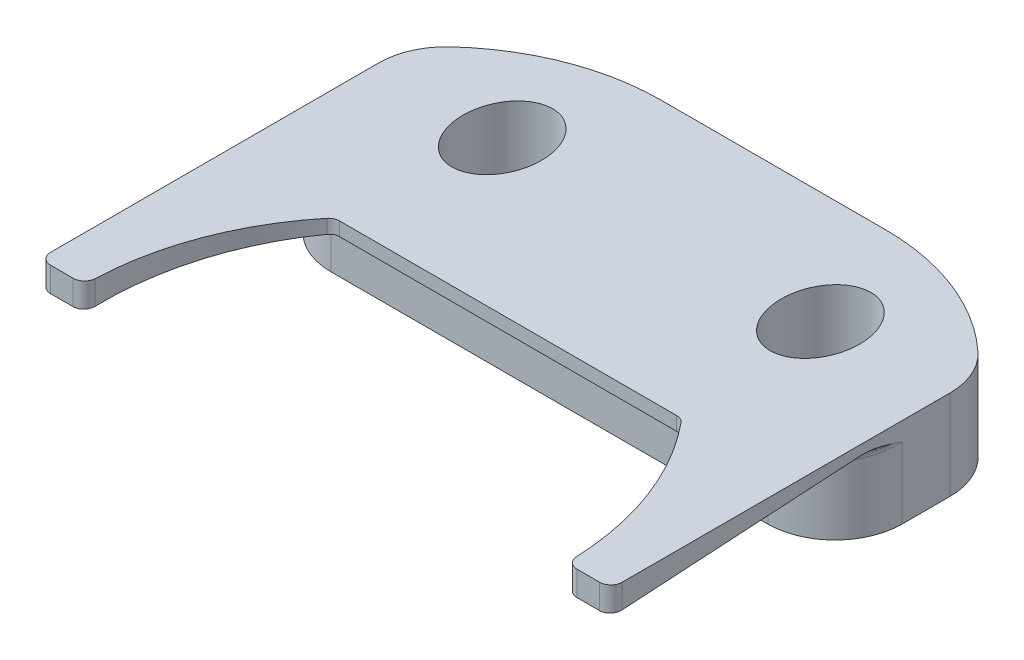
ISO-10303-21;
HEADER;
FILE_DESCRIPTION(('STEP AP214'),'2;1');
FILE_NAME('part.step','',(''),(''),'','','');
FILE_SCHEMA(('AUTOMOTIVE_DESIGN { 1 0 10303 214 1 1 1 1 }'));
ENDSEC;
DATA;
#1=APPLICATION_CONTEXT('core data for automotive mechanical design processes');
#2=APPLICATION_PROTOCOL_DEFINITION('international standard','automotive_design',2000,#1);
#3=PRODUCT_CONTEXT('',#1,'mechanical');
#4=PRODUCT('Part','Part','',(#3));
#5=PRODUCT_RELATED_PRODUCT_CATEGORY('part','',(#4));
#6=PRODUCT_DEFINITION_FORMATION('','',#4);
#7=PRODUCT_DEFINITION_CONTEXT('part definition',#1,'design');
#8=PRODUCT_DEFINITION('design','',#6,#7);
#9=PRODUCT_DEFINITION_SHAPE('','',#8);
#10=(LENGTH_UNIT() NAMED_UNIT(*) SI_UNIT(.MILLI.,.METRE.));
#11=(NAMED_UNIT(*) PLANE_ANGLE_UNIT() SI_UNIT($,.RADIAN.));
#12=(NAMED_UNIT(*) SI_UNIT($,.STERADIAN.) SOLID_ANGLE_UNIT());
#13=UNCERTAINTY_MEASURE_WITH_UNIT(LENGTH_MEASURE(1.E-05),#10,'distance_accuracy_value','');
#14=(GEOMETRIC_REPRESENTATION_CONTEXT(3) GLOBAL_UNCERTAINTY_ASSIGNED_CONTEXT((#13)) GLOBAL_UNIT_ASSIGNED_CONTEXT((#10,
#11,#12)) REPRESENTATION_CONTEXT('',''));
#15=CARTESIAN_POINT('',(0.,0.,0.));
#16=DIRECTION('',(0.,0.,1.));
#17=DIRECTION('',(1.,0.,0.));
#18=AXIS2_PLACEMENT_3D('',#15,#16,#17);
#19=CARTESIAN_POINT('',(-22.8103180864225,4.,15.));
#20=DIRECTION('',(0.,0.,1.));
#21=DIRECTION('',(1.,0.,0.));
#22=AXIS2_PLACEMENT_3D('',#19,#20,#21);
#23=PLANE('',#22);
#24=DIRECTION('',(1.,0.,0.));
#25=VECTOR('',#24,1.);
#26=CARTESIAN_POINT('',(-22.8103180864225,2.9,15.));
#27=LINE('',#26,#25);
#28=CARTESIAN_POINT('',(-12.25,2.9,15.));
#29=VERTEX_POINT('',#28);
#30=CARTESIAN_POINT('',(-11.2404524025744,2.9,15.));
#31=VERTEX_POINT('',#30);
#32=EDGE_CURVE('E543',#29,#31,#27,.T.);
#33=ORIENTED_EDGE('',*,*,#32,.T.);
#34=DIRECTION('',(0.,-1.,0.));
#35=VECTOR('',#34,1.);
#36=CARTESIAN_POINT('',(-11.2404524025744,4.,15.));
#37=LINE('',#36,#35);
#38=CARTESIAN_POINT('',(-11.2404524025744,4.,15.));
#39=VERTEX_POINT('',#38);
#40=EDGE_CURVE('E63',#31,#39,#37,.F.);
#41=ORIENTED_EDGE('',*,*,#40,.T.);
#42=DIRECTION('',(1.,0.,0.));
#43=VECTOR('',#42,1.);
#44=CARTESIAN_POINT('',(-22.8103180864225,4.,15.));
#45=LINE('',#44,#43);
#46=CARTESIAN_POINT('',(-12.25,4.,15.));
#47=VERTEX_POINT('',#46);
#48=EDGE_CURVE('E499',#47,#39,#45,.T.);
#49=ORIENTED_EDGE('',*,*,#48,.F.);
#50=DIRECTION('',(0.,1.,0.));
#51=VECTOR('',#50,1.);
#52=CARTESIAN_POINT('',(-12.25,2.9,15.));
#53=LINE('',#52,#51);
#54=EDGE_CURVE('E394',#47,#29,#53,.F.);
#55=ORIENTED_EDGE('',*,*,#54,.T.);
#56=EDGE_LOOP('',(#33,#41,#49,#55));
#57=FACE_BOUND('',#56,.T.);
#58=ADVANCED_FACE('F45',(#57),#23,.T.);
#59=CARTESIAN_POINT('',(12.75,4.,4.99999999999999));
#60=DIRECTION('',(0.,0.,-1.));
#61=DIRECTION('',(-1.,0.,0.));
#62=AXIS2_PLACEMENT_3D('',#59,#60,#61);
#63=PLANE('',#62);
#64=DIRECTION('',(0.,-1.,0.));
#65=VECTOR('',#64,1.);
#66=CARTESIAN_POINT('',(9.75000000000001,4.,4.99999999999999));
#67=LINE('',#66,#65);
#68=CARTESIAN_POINT('',(9.75000000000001,0.,4.99999999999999));
#69=VERTEX_POINT('',#68);
#70=CARTESIAN_POINT('',(9.75000000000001,2.96910080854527,4.99999999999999));
#71=VERTEX_POINT('',#70);
#72=EDGE_CURVE('E316',#69,#71,#67,.F.);
#73=ORIENTED_EDGE('',*,*,#72,.T.);
#74=DIRECTION('',(1.,0.,0.));
#75=VECTOR('',#74,1.);
#76=CARTESIAN_POINT('',(12.75,2.96910080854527,4.99999999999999));
#77=LINE('',#76,#75);
#78=CARTESIAN_POINT('',(-9.74999999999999,2.96910080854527,5.00000000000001));
#79=VERTEX_POINT('',#78);
#80=EDGE_CURVE('E348',#71,#79,#77,.F.);
#81=ORIENTED_EDGE('',*,*,#80,.T.);
#82=DIRECTION('',(0.,-1.,0.));
#83=VECTOR('',#82,1.);
#84=CARTESIAN_POINT('',(-9.74999999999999,4.,5.00000000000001));
#85=LINE('',#84,#83);
#86=CARTESIAN_POINT('',(-9.74999999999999,0.,5.00000000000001));
#87=VERTEX_POINT('',#86);
#88=EDGE_CURVE('E313',#79,#87,#85,.T.);
#89=ORIENTED_EDGE('',*,*,#88,.T.);
#90=DIRECTION('',(1.,0.,0.));
#91=VECTOR('',#90,1.);
#92=CARTESIAN_POINT('',(12.75,0.,4.99999999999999));
#93=LINE('',#92,#91);
#94=EDGE_CURVE('E266',#87,#69,#93,.T.);
#95=ORIENTED_EDGE('',*,*,#94,.T.);
#96=EDGE_LOOP('',(#73,#81,#89,#95));
#97=FACE_BOUND('',#96,.T.);
#98=ADVANCED_FACE('F434',(#97),#63,.F.);
#99=CARTESIAN_POINT('',(4.99999999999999,4.,5.));
#100=DIRECTION('',(0.,1.,0.));
#101=DIRECTION('',(0.,0.,1.));
#102=AXIS2_PLACEMENT_3D('',#99,#100,#101);
#103=PLANE('',#102);
#104=CARTESIAN_POINT('',(11.2404524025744,4.,15.));
#105=VERTEX_POINT('',#104);
#106=CARTESIAN_POINT('',(12.25,4.,15.));
#107=VERTEX_POINT('',#106);
#108=EDGE_CURVE('E554',#105,#107,#45,.T.);
#109=ORIENTED_EDGE('',*,*,#108,.T.);
#110=CARTESIAN_POINT('',(12.25,4.,14.5));
#111=DIRECTION('',(0.,1.,0.));
#112=DIRECTION('',(0.,0.,1.));
#113=AXIS2_PLACEMENT_3D('',#110,#111,#112);
#114=CIRCLE('',#113,0.5);
#115=CARTESIAN_POINT('',(12.75,4.,14.5));
#116=VERTEX_POINT('',#115);
#117=EDGE_CURVE('E391',#107,#116,#114,.T.);
#118=ORIENTED_EDGE('',*,*,#117,.T.);
#119=DIRECTION('',(0.,0.,-1.));
#120=VECTOR('',#119,1.);
#121=CARTESIAN_POINT('',(12.75,4.,4.99999999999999));
#122=LINE('',#121,#120);
#123=CARTESIAN_POINT('',(12.75,4.,-0.141740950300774));
#124=VERTEX_POINT('',#123);
#125=EDGE_CURVE('E222',#116,#124,#122,.T.);
#126=ORIENTED_EDGE('',*,*,#125,.T.);
#127=CARTESIAN_POINT('',(9.75,4.,-0.14174095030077));
#128=DIRECTION('',(0.,1.,0.));
#129=DIRECTION('',(0.,0.,1.));
#130=AXIS2_PLACEMENT_3D('',#127,#128,#129);
#131=CIRCLE('',#130,3.);
#132=CARTESIAN_POINT('',(11.7857142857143,4.,-2.34534421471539));
#133=VERTEX_POINT('',#132);
#134=EDGE_CURVE('E217',#124,#133,#131,.T.);
#135=ORIENTED_EDGE('',*,*,#134,.T.);
#136=CARTESIAN_POINT('',(4.99999999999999,4.,5.));
#137=DIRECTION('',(0.,1.,0.));
#138=DIRECTION('',(0.,0.,1.));
#139=AXIS2_PLACEMENT_3D('',#136,#137,#138);
#140=CIRCLE('',#139,9.99999999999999);
#141=CARTESIAN_POINT('',(4.99999999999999,4.,-4.99999999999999));
#142=VERTEX_POINT('',#141);
#143=EDGE_CURVE('E207',#133,#142,#140,.T.);
#144=ORIENTED_EDGE('',*,*,#143,.T.);
#145=DIRECTION('',(-1.,0.,0.));
#146=VECTOR('',#145,1.);
#147=CARTESIAN_POINT('',(4.99999999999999,4.,-4.99999999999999));
#148=LINE('',#147,#146);
#149=CARTESIAN_POINT('',(-4.99999999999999,4.,-4.99999999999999));
#150=VERTEX_POINT('',#149);
#151=EDGE_CURVE('E214',#142,#150,#148,.T.);
#152=ORIENTED_EDGE('',*,*,#151,.T.);
#153=CARTESIAN_POINT('',(-4.99999999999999,4.,5.));
#154=DIRECTION('',(0.,1.,0.));
#155=DIRECTION('',(0.,0.,-1.));
#156=AXIS2_PLACEMENT_3D('',#153,#154,#155);
#157=CIRCLE('',#156,9.99999999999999);
#158=CARTESIAN_POINT('',(-11.7857142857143,4.,-2.34534421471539));
#159=VERTEX_POINT('',#158);
#160=EDGE_CURVE('E239',#150,#159,#157,.T.);
#161=ORIENTED_EDGE('',*,*,#160,.T.);
#162=CARTESIAN_POINT('',(-9.75,4.,-0.141740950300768));
#163=DIRECTION('',(0.,1.,0.));
#164=DIRECTION('',(0.,0.,1.));
#165=AXIS2_PLACEMENT_3D('',#162,#163,#164);
#166=CIRCLE('',#165,3.);
#167=CARTESIAN_POINT('',(-12.75,4.,-0.141740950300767));
#168=VERTEX_POINT('',#167);
#169=EDGE_CURVE('E297',#159,#168,#166,.T.);
#170=ORIENTED_EDGE('',*,*,#169,.T.);
#171=DIRECTION('',(0.,0.,1.));
#172=VECTOR('',#171,1.);
#173=CARTESIAN_POINT('',(-12.75,4.,5.00000000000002));
#174=LINE('',#173,#172);
#175=CARTESIAN_POINT('',(-12.75,4.,14.5));
#176=VERTEX_POINT('',#175);
#177=EDGE_CURVE('E242',#168,#176,#174,.T.);
#178=ORIENTED_EDGE('',*,*,#177,.T.);
#179=CARTESIAN_POINT('',(-12.25,4.,14.5));
#180=DIRECTION('',(0.,1.,0.));
#181=DIRECTION('',(0.,0.,1.));
#182=AXIS2_PLACEMENT_3D('',#179,#180,#181);
#183=CIRCLE('',#182,0.5);
#184=EDGE_CURVE('E70',#176,#47,#183,.T.);
#185=ORIENTED_EDGE('',*,*,#184,.T.);
#186=ORIENTED_EDGE('',*,*,#48,.T.);
#187=CARTESIAN_POINT('',(-11.2404524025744,4.,14.5));
#188=DIRECTION('',(0.,1.,0.));
#189=DIRECTION('',(0.,0.,1.));
#190=AXIS2_PLACEMENT_3D('',#187,#188,#189);
#191=CIRCLE('',#190,0.5);
#192=CARTESIAN_POINT('',(-10.7408168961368,4.,14.5190882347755));
#193=VERTEX_POINT('',#192);
#194=EDGE_CURVE('E385',#39,#193,#191,.T.);
#195=ORIENTED_EDGE('',*,*,#194,.T.);
#196=CARTESIAN_POINT('',(1.84707277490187,4.,15.));
#197=DIRECTION('',(0.,1.,0.));
#198=DIRECTION('',(0.,0.,-1.));
#199=AXIS2_PLACEMENT_3D('',#196,#197,#198);
#200=CIRCLE('',#199,12.5970727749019);
#201=CARTESIAN_POINT('',(-7.90296450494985,4.,7.0235963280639));
#202=VERTEX_POINT('',#201);
#203=EDGE_CURVE('E576',#202,#193,#200,.T.);
#204=ORIENTED_EDGE('',*,*,#203,.F.);
#205=CARTESIAN_POINT('',(-7.51596835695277,4.,7.34019383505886));
#206=DIRECTION('',(0.,1.,0.));
#207=DIRECTION('',(0.,0.,1.));
#208=AXIS2_PLACEMENT_3D('',#205,#206,#207);
#209=CIRCLE('',#208,0.5);
#210=CARTESIAN_POINT('',(-7.51596835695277,4.,6.84019383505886));
#211=VERTEX_POINT('',#210);
#212=EDGE_CURVE('E55',#202,#211,#209,.F.);
#213=ORIENTED_EDGE('',*,*,#212,.T.);
#214=DIRECTION('',(-1.,0.,0.));
#215=VECTOR('',#214,1.);
#216=CARTESIAN_POINT('',(-7.74999999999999,4.,6.84019383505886));
#217=LINE('',#216,#215);
#218=CARTESIAN_POINT('',(7.51596835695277,4.,6.84019383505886));
#219=VERTEX_POINT('',#218);
#220=EDGE_CURVE('E619',#219,#211,#217,.T.);
#221=ORIENTED_EDGE('',*,*,#220,.F.);
#222=CARTESIAN_POINT('',(7.51596835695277,4.,7.34019383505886));
#223=DIRECTION('',(0.,1.,0.));
#224=DIRECTION('',(0.,0.,1.));
#225=AXIS2_PLACEMENT_3D('',#222,#223,#224);
#226=CIRCLE('',#225,0.5);
#227=CARTESIAN_POINT('',(7.90296450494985,4.,7.0235963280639));
#228=VERTEX_POINT('',#227);
#229=EDGE_CURVE('E589',#219,#228,#226,.F.);
#230=ORIENTED_EDGE('',*,*,#229,.T.);
#231=CARTESIAN_POINT('',(-1.84707277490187,4.,15.));
#232=DIRECTION('',(0.,1.,0.));
#233=DIRECTION('',(0.,0.,1.));
#234=AXIS2_PLACEMENT_3D('',#231,#232,#233);
#235=CIRCLE('',#234,12.5970727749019);
#236=CARTESIAN_POINT('',(10.7408168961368,4.,14.5190882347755));
#237=VERTEX_POINT('',#236);
#238=EDGE_CURVE('E580',#237,#228,#235,.T.);
#239=ORIENTED_EDGE('',*,*,#238,.F.);
#240=CARTESIAN_POINT('',(11.2404524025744,4.,14.5));
#241=DIRECTION('',(0.,1.,0.));
#242=DIRECTION('',(0.,0.,1.));
#243=AXIS2_PLACEMENT_3D('',#240,#241,#242);
#244=CIRCLE('',#243,0.5);
#245=EDGE_CURVE('E388',#237,#105,#244,.T.);
#246=ORIENTED_EDGE('',*,*,#245,.T.);
#247=EDGE_LOOP('',(#109,#118,#126,#135,#144,#152,#161,#170,#178,#185,#186,#195,#204,#213,#221,
#230,#239,#246));
#248=FACE_BOUND('',#247,.T.);
#249=CARTESIAN_POINT('',(-7.1,4.,0.));
#250=DIRECTION('',(0.,1.,0.));
#251=DIRECTION('',(0.,0.,1.));
#252=AXIS2_PLACEMENT_3D('',#249,#250,#251);
#253=ELLIPSE('',#252,2.25,1.75);
#254=CARTESIAN_POINT('',(-7.09999999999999,4.,2.25));
#255=VERTEX_POINT('',#254);
#256=EDGE_CURVE('E252',#255,#255,#253,.T.);
#257=ORIENTED_EDGE('',*,*,#256,.F.);
#258=EDGE_LOOP('',(#257));
#259=FACE_BOUND('',#258,.T.);
#260=CARTESIAN_POINT('',(7.1,4.,0.));
#261=DIRECTION('',(0.,1.,0.));
#262=DIRECTION('',(0.,0.,1.));
#263=AXIS2_PLACEMENT_3D('',#260,#261,#262);
#264=ELLIPSE('',#263,2.25,1.75);
#265=CARTESIAN_POINT('',(7.1,4.,2.25));
#266=VERTEX_POINT('',#265);
#267=EDGE_CURVE('E491',#266,#266,#264,.T.);
#268=ORIENTED_EDGE('',*,*,#267,.F.);
#269=EDGE_LOOP('',(#268));
#270=FACE_BOUND('',#269,.T.);
#271=ADVANCED_FACE('F210',(#248,#259,#270),#103,.T.);
#272=CARTESIAN_POINT('',(4.99999999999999,0.,5.));
#273=DIRECTION('',(0.,1.,0.));
#274=DIRECTION('',(0.,0.,1.));
#275=AXIS2_PLACEMENT_3D('',#272,#273,#274);
#276=PLANE('',#275);
#277=CARTESIAN_POINT('',(4.99999999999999,0.,5.));
#278=DIRECTION('',(0.,1.,0.));
#279=DIRECTION('',(0.,0.,1.));
#280=AXIS2_PLACEMENT_3D('',#277,#278,#279);
#281=CIRCLE('',#280,9.99999999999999);
#282=CARTESIAN_POINT('',(11.7857142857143,0.,-2.34534421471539));
#283=VERTEX_POINT('',#282);
#284=CARTESIAN_POINT('',(4.99999999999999,0.,-4.99999999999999));
#285=VERTEX_POINT('',#284);
#286=EDGE_CURVE('E228',#283,#285,#281,.T.);
#287=ORIENTED_EDGE('',*,*,#286,.F.);
#288=CARTESIAN_POINT('',(9.75,0.,-0.14174095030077));
#289=DIRECTION('',(0.,1.,0.));
#290=DIRECTION('',(0.,0.,1.));
#291=AXIS2_PLACEMENT_3D('',#288,#289,#290);
#292=CIRCLE('',#291,3.);
#293=CARTESIAN_POINT('',(12.75,0.,-0.141740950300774));
#294=VERTEX_POINT('',#293);
#295=EDGE_CURVE('E287',#283,#294,#292,.F.);
#296=ORIENTED_EDGE('',*,*,#295,.T.);
#297=DIRECTION('',(0.,0.,-1.));
#298=VECTOR('',#297,1.);
#299=CARTESIAN_POINT('',(12.75,0.,4.99999999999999));
#300=LINE('',#299,#298);
#301=CARTESIAN_POINT('',(12.75,0.,1.99999999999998));
#302=VERTEX_POINT('',#301);
#303=EDGE_CURVE('E248',#302,#294,#300,.T.);
#304=ORIENTED_EDGE('',*,*,#303,.F.);
#305=CARTESIAN_POINT('',(9.75,0.,1.99999999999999));
#306=DIRECTION('',(0.,1.,0.));
#307=DIRECTION('',(0.,0.,1.));
#308=AXIS2_PLACEMENT_3D('',#305,#306,#307);
#309=CIRCLE('',#308,3.);
#310=EDGE_CURVE('E281',#302,#69,#309,.F.);
#311=ORIENTED_EDGE('',*,*,#310,.T.);
#312=ORIENTED_EDGE('',*,*,#94,.F.);
#313=CARTESIAN_POINT('',(-9.74999999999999,0.,2.00000000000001));
#314=DIRECTION('',(0.,1.,0.));
#315=DIRECTION('',(0.,0.,1.));
#316=AXIS2_PLACEMENT_3D('',#313,#314,#315);
#317=CIRCLE('',#316,3.);
#318=CARTESIAN_POINT('',(-12.75,0.,2.00000000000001));
#319=VERTEX_POINT('',#318);
#320=EDGE_CURVE('E278',#87,#319,#317,.F.);
#321=ORIENTED_EDGE('',*,*,#320,.T.);
#322=DIRECTION('',(0.,0.,1.));
#323=VECTOR('',#322,1.);
#324=CARTESIAN_POINT('',(-12.75,0.,5.00000000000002));
#325=LINE('',#324,#323);
#326=CARTESIAN_POINT('',(-12.75,0.,-0.141740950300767));
#327=VERTEX_POINT('',#326);
#328=EDGE_CURVE('E262',#327,#319,#325,.T.);
#329=ORIENTED_EDGE('',*,*,#328,.F.);
#330=CARTESIAN_POINT('',(-9.75,0.,-0.141740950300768));
#331=DIRECTION('',(0.,1.,0.));
#332=DIRECTION('',(0.,0.,1.));
#333=AXIS2_PLACEMENT_3D('',#330,#331,#332);
#334=CIRCLE('',#333,3.);
#335=CARTESIAN_POINT('',(-11.7857142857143,0.,-2.34534421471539));
#336=VERTEX_POINT('',#335);
#337=EDGE_CURVE('E284',#327,#336,#334,.F.);
#338=ORIENTED_EDGE('',*,*,#337,.T.);
#339=CARTESIAN_POINT('',(-4.99999999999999,0.,5.));
#340=DIRECTION('',(0.,1.,0.));
#341=DIRECTION('',(0.,0.,-1.));
#342=AXIS2_PLACEMENT_3D('',#339,#340,#341);
#343=CIRCLE('',#342,9.99999999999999);
#344=CARTESIAN_POINT('',(-4.99999999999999,0.,-4.99999999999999));
#345=VERTEX_POINT('',#344);
#346=EDGE_CURVE('E258',#345,#336,#343,.T.);
#347=ORIENTED_EDGE('',*,*,#346,.F.);
#348=DIRECTION('',(-1.,0.,0.));
#349=VECTOR('',#348,1.);
#350=CARTESIAN_POINT('',(4.99999999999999,0.,-4.99999999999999));
#351=LINE('',#350,#349);
#352=EDGE_CURVE('E255',#285,#345,#351,.T.);
#353=ORIENTED_EDGE('',*,*,#352,.F.);
#354=EDGE_LOOP('',(#287,#296,#304,#311,#312,#321,#329,#338,#347,#353));
#355=FACE_BOUND('',#354,.T.);
#356=CARTESIAN_POINT('',(-7.1,0.,0.));
#357=DIRECTION('',(0.,1.,0.));
#358=DIRECTION('',(0.,0.,1.));
#359=AXIS2_PLACEMENT_3D('',#356,#357,#358);
#360=ELLIPSE('',#359,2.25,1.75);
#361=CARTESIAN_POINT('',(-7.09999999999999,0.,2.25));
#362=VERTEX_POINT('',#361);
#363=EDGE_CURVE('E497',#362,#362,#360,.T.);
#364=ORIENTED_EDGE('',*,*,#363,.T.);
#365=EDGE_LOOP('',(#364));
#366=FACE_BOUND('',#365,.T.);
#367=CARTESIAN_POINT('',(7.1,0.,0.));
#368=DIRECTION('',(0.,1.,0.));
#369=DIRECTION('',(0.,0.,1.));
#370=AXIS2_PLACEMENT_3D('',#367,#368,#369);
#371=ELLIPSE('',#370,2.25,1.75);
#372=CARTESIAN_POINT('',(7.1,0.,2.25));
#373=VERTEX_POINT('',#372);
#374=EDGE_CURVE('E498',#373,#373,#371,.T.);
#375=ORIENTED_EDGE('',*,*,#374,.T.);
#376=EDGE_LOOP('',(#375));
#377=FACE_BOUND('',#376,.T.);
#378=ADVANCED_FACE('F446',(#355,#366,#377),#276,.F.);
#379=CARTESIAN_POINT('',(12.75,4.,4.99999999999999));
#380=DIRECTION('',(-1.,0.,0.));
#381=DIRECTION('',(0.,0.,1.));
#382=AXIS2_PLACEMENT_3D('',#379,#380,#381);
#383=PLANE('',#382);
#384=ORIENTED_EDGE('',*,*,#125,.F.);
#385=DIRECTION('',(0.,-1.,0.));
#386=VECTOR('',#385,1.);
#387=CARTESIAN_POINT('',(12.75,2.9,14.5));
#388=LINE('',#387,#386);
#389=CARTESIAN_POINT('',(12.75,2.93,14.5));
#390=VERTEX_POINT('',#389);
#391=EDGE_CURVE('E373',#116,#390,#388,.T.);
#392=ORIENTED_EDGE('',*,*,#391,.T.);
#393=DIRECTION('',(0.,0.0598922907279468,-0.998204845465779));
#394=VECTOR('',#393,1.);
#395=CARTESIAN_POINT('',(12.75,2.9,15.));
#396=LINE('',#395,#394);
#397=CARTESIAN_POINT('',(12.75,3.57003669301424,3.83272178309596));
#398=VERTEX_POINT('',#397);
#399=EDGE_CURVE('E551',#390,#398,#396,.T.);
#400=ORIENTED_EDGE('',*,*,#399,.T.);
#401=CARTESIAN_POINT('',(9.75,2.96910080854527,4.99999999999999));
#402=CARTESIAN_POINT('',(9.75,3.5,4.99999999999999));
#403=CARTESIAN_POINT('',(9.75,3.46820323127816,5.52994614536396));
#404=CARTESIAN_POINT('',(9.61909918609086,2.96910080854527,4.99999999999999));
#405=CARTESIAN_POINT('',(9.62048894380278,3.5,4.99999999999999));
#406=CARTESIAN_POINT('',(9.59728238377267,3.46820323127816,5.52994614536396));
#407=CARTESIAN_POINT('',(9.48819837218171,2.96970140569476,4.99142004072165));
#408=CARTESIAN_POINT('',(9.49100148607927,3.50050362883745,4.99160618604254));
#409=CARTESIAN_POINT('',(9.44456476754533,3.46880382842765,5.51993619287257));
#410=CARTESIAN_POINT('',(9.22863658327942,2.97209344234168,4.95724808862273));
#411=CARTESIAN_POINT('',(9.23412004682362,3.50251082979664,4.95815283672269));
#412=CARTESIAN_POINT('',(9.14174268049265,3.47119586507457,5.48006891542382));
#413=CARTESIAN_POINT('',(9.09997574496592,2.97388495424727,4.93165506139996));
#414=CARTESIAN_POINT('',(9.10677176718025,3.50401373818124,4.93310436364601));
#415=CARTESIAN_POINT('',(8.99163836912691,3.47298737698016,5.45021038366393));
#416=CARTESIAN_POINT('',(8.84709513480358,2.97862809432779,4.86389591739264));
#417=CARTESIAN_POINT('',(8.85628164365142,3.50799626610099,4.86672889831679));
#418=CARTESIAN_POINT('',(8.69661099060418,3.47773051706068,5.37115804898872));
#419=CARTESIAN_POINT('',(8.7228758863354,2.98157985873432,4.82172785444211));
#420=CARTESIAN_POINT('',(8.73318111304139,3.51047460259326,4.82542329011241));
#421=CARTESIAN_POINT('',(8.55168853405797,3.48068228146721,5.32196197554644));
#422=CARTESIAN_POINT('',(8.48100343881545,2.98859293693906,4.72154102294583));
#423=CARTESIAN_POINT('',(8.49324082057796,3.5163690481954,4.7271825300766));
#424=CARTESIAN_POINT('',(8.26950401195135,3.48769535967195,5.20507733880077));
#425=CARTESIAN_POINT('',(8.36335133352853,2.99265443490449,4.66351962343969));
#426=CARTESIAN_POINT('',(8.37643537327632,3.51978334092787,4.6702776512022));
#427=CARTESIAN_POINT('',(8.13224322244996,3.49175685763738,5.13738570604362));
#428=CARTESIAN_POINT('',(8.13662562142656,3.00181744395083,4.53261949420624));
#429=CARTESIAN_POINT('',(8.15104989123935,3.52749545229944,4.54174246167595));
#430=CARTESIAN_POINT('',(7.86772989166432,3.50091986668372,4.98466888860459));
#431=CARTESIAN_POINT('',(8.02755376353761,3.00691916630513,4.45973774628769));
#432=CARTESIAN_POINT('',(8.04249501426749,3.531791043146,4.47014928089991));
#433=CARTESIAN_POINT('',(7.74047939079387,3.50602158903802,4.89964018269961));
#434=CARTESIAN_POINT('',(7.8198541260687,3.01807531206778,4.30036423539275));
#435=CARTESIAN_POINT('',(7.83545460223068,3.54119679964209,4.31338667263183));
#436=CARTESIAN_POINT('',(7.49816314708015,3.51717773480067,4.71370441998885));
#437=CARTESIAN_POINT('',(7.7212287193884,3.02412995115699,4.21386939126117));
#438=CARTESIAN_POINT('',(7.73698350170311,3.54630447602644,4.22825873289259));
#439=CARTESIAN_POINT('',(7.3831001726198,3.52323237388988,4.61279376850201));
#440=CARTESIAN_POINT('',(7.53610888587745,3.037088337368,4.0287495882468));
#441=CARTESIAN_POINT('',(7.55180321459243,3.55725157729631,4.04580704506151));
#442=CARTESIAN_POINT('',(7.16712703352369,3.53619076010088,4.39682066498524));
#443=CARTESIAN_POINT('',(7.44961730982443,3.04399228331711,3.93012178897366));
#444=CARTESIAN_POINT('',(7.46509686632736,3.56308841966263,3.94852633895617));
#445=CARTESIAN_POINT('',(7.06622019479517,3.54309470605,4.28175489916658));
#446=CARTESIAN_POINT('',(7.29024460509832,3.05853117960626,3.72242327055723));
#447=CARTESIAN_POINT('',(7.30495754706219,3.57539822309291,3.74336294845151));
#448=CARTESIAN_POINT('',(6.8802853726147,3.55763360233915,4.03943996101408));
#449=CARTESIAN_POINT('',(7.21736656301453,3.06616629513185,3.61335019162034));
#450=CARTESIAN_POINT('',(7.23151569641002,3.58186868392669,3.63552193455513));
#451=CARTESIAN_POINT('',(6.79526099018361,3.56526871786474,3.91218803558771));
#452=CARTESIAN_POINT('',(7.08646773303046,3.08203693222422,3.38662680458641));
#453=CARTESIAN_POINT('',(7.09920752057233,3.59533861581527,3.4110230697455));
#454=CARTESIAN_POINT('',(6.64254568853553,3.58113935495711,3.64767741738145));
#455=CARTESIAN_POINT('',(7.02844996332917,3.09027257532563,3.26897476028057));
#456=CARTESIAN_POINT('',(7.0403212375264,3.60233584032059,3.29440266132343));
#457=CARTESIAN_POINT('',(6.57485829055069,3.58937499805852,3.51041669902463));
#458=CARTESIAN_POINT('',(6.92826454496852,3.10720340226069,3.02710580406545));
#459=CARTESIAN_POINT('',(6.93819112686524,3.61674229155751,3.05429514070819));
#460=CARTESIAN_POINT('',(6.45797530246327,3.60630582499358,3.228236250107));
#461=CARTESIAN_POINT('',(6.88609952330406,3.11589866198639,2.90288780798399));
#462=CARTESIAN_POINT('',(6.89491762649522,3.62414968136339,2.93083864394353));
#463=CARTESIAN_POINT('',(6.40878277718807,3.61500108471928,3.08331525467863));
#464=CARTESIAN_POINT('',(6.8183415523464,3.13359999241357,2.65001165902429));
#465=CARTESIAN_POINT('',(6.82482200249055,3.6392513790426,2.67914368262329));
#466=CARTESIAN_POINT('',(6.3297318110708,3.63270241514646,2.78829308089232));
#467=CARTESIAN_POINT('',(6.79275054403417,3.1426060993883,2.52135298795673));
#468=CARTESIAN_POINT('',(6.79796249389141,3.64694438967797,2.55092683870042));
#469=CARTESIAN_POINT('',(6.29987563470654,3.64170852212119,2.63819129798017));
#470=CARTESIAN_POINT('',(6.75857925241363,3.16077506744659,2.26179630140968));
#471=CARTESIAN_POINT('',(6.76122688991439,3.66248621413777,2.29189643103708));
#472=CARTESIAN_POINT('',(6.2600091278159,3.65987749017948,2.33537516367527));
#473=CARTESIAN_POINT('',(6.75,3.16993793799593,2.13089815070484));
#474=CARTESIAN_POINT('',(6.75130821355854,3.67033436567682,2.16109390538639));
#475=CARTESIAN_POINT('',(6.25,3.66904036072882,2.18266065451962));
#476=CARTESIAN_POINT('',(6.75,3.18826367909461,1.86910184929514));
#477=CARTESIAN_POINT('',(6.74869520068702,3.68605156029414,1.8991406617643));
#478=CARTESIAN_POINT('',(6.25,3.6873661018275,1.87723163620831));
#479=CARTESIAN_POINT('',(6.75857925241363,3.19742654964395,1.73820369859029));
#480=CARTESIAN_POINT('',(6.75595595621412,3.69392062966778,1.76798950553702));
#481=CARTESIAN_POINT('',(6.2600091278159,3.69652897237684,1.72451712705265));
#482=CARTESIAN_POINT('',(6.79275054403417,3.21559551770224,1.47864701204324));
#483=CARTESIAN_POINT('',(6.78764267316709,3.70954333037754,1.50761116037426));
#484=CARTESIAN_POINT('',(6.29987563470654,3.71469794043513,1.42170099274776));
#485=CARTESIAN_POINT('',(6.8183415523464,3.22460162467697,1.34998834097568));
#486=CARTESIAN_POINT('',(6.81202443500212,3.71729768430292,1.37837192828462));
#487=CARTESIAN_POINT('',(6.3297318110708,3.72370404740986,1.27159920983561));
#488=CARTESIAN_POINT('',(6.88609952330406,3.24230295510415,1.09711219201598));
#489=CARTESIAN_POINT('',(6.87759076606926,3.73255567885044,1.12407201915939));
#490=CARTESIAN_POINT('',(6.40878277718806,3.74140537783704,0.97657703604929));
#491=CARTESIAN_POINT('',(6.92826454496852,3.25099821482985,0.972894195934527));
#492=CARTESIAN_POINT('',(6.9187348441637,3.74006069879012,0.99898835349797));
#493=CARTESIAN_POINT('',(6.45797530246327,3.75010063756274,0.831656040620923));
#494=CARTESIAN_POINT('',(7.02844996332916,3.26792904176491,0.731025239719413));
#495=CARTESIAN_POINT('',(7.01716298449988,3.75468831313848,0.755194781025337));
#496=CARTESIAN_POINT('',(6.57485829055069,3.7670314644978,0.549475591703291));
#497=CARTESIAN_POINT('',(7.08646773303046,3.27616468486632,0.613373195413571));
#498=CARTESIAN_POINT('',(7.07441302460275,3.76181285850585,0.636452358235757));
#499=CARTESIAN_POINT('',(6.64254568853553,3.77526710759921,0.412214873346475));
#500=CARTESIAN_POINT('',(7.21736656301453,3.2920353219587,0.386649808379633));
#501=CARTESIAN_POINT('',(7.20409883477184,3.77555386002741,0.407435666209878));
#502=CARTESIAN_POINT('',(6.79526099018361,3.79113774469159,0.147704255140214));
#503=CARTESIAN_POINT('',(7.29024460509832,3.29967043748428,0.277576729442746));
#504=CARTESIAN_POINT('',(7.27650937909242,3.78217271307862,0.297121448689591));
#505=CARTESIAN_POINT('',(6.8802853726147,3.79877286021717,0.0204523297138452));
#506=CARTESIAN_POINT('',(7.44961730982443,3.31420933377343,0.0698782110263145));
#507=CARTESIAN_POINT('',(7.43528558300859,3.79478511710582,0.0869147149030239));
#508=CARTESIAN_POINT('',(7.06622019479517,3.81331175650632,-0.221862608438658));
#509=CARTESIAN_POINT('',(7.53610888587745,3.32111327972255,-0.028749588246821));
#510=CARTESIAN_POINT('',(7.52163653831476,3.80078135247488,-0.0130225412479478));
#511=CARTESIAN_POINT('',(7.16712703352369,3.82021570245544,-0.336928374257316));
#512=CARTESIAN_POINT('',(7.7212287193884,3.33407166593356,-0.213869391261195));
#513=CARTESIAN_POINT('',(7.7068074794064,3.81204202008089,-0.200700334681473));
#514=CARTESIAN_POINT('',(7.3831001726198,3.83317408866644,-0.552901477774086));
#515=CARTESIAN_POINT('',(7.8198541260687,3.34012630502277,-0.300364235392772));
#516=CARTESIAN_POINT('',(7.80562427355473,3.81730924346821,-0.288487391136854));
#517=CARTESIAN_POINT('',(7.49816314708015,3.83922872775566,-0.653812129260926));
#518=CARTESIAN_POINT('',(8.02755376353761,3.35128245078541,-0.459737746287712));
#519=CARTESIAN_POINT('',(8.01401162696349,3.82701816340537,-0.450302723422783));
#520=CARTESIAN_POINT('',(7.74047939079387,3.8503848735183,-0.839747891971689));
#521=CARTESIAN_POINT('',(8.13662562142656,3.35638417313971,-0.53261949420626));
#522=CARTESIAN_POINT('',(8.12359068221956,3.83146256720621,-0.524376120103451));
#523=CARTESIAN_POINT('',(7.86772989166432,3.8554865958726,-0.924776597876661));
#524=CARTESIAN_POINT('',(8.36335133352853,3.36554718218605,-0.663519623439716));
#525=CARTESIAN_POINT('',(8.35158923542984,3.83944672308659,-0.657445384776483));
#526=CARTESIAN_POINT('',(8.13224322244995,3.86464960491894,-1.07749341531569));
#527=CARTESIAN_POINT('',(8.48100343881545,3.36960868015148,-0.721541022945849));
#528=CARTESIAN_POINT('',(8.47002825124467,3.84298891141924,-0.716481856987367));
#529=CARTESIAN_POINT('',(8.26950401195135,3.86871110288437,-1.14518504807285));
#530=CARTESIAN_POINT('',(8.7228758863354,3.37662175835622,-0.821727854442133));
#531=CARTESIAN_POINT('',(8.71367061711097,3.8491056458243,-0.818427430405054));
#532=CARTESIAN_POINT('',(8.55168853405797,3.87572418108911,-1.26206968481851));
#533=CARTESIAN_POINT('',(8.84709513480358,3.37957352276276,-0.863895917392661));
#534=CARTESIAN_POINT('',(8.83890303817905,3.85168218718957,-0.861369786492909));
#535=CARTESIAN_POINT('',(8.69661099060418,3.87867594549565,-1.3112657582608));
#536=CARTESIAN_POINT('',(9.09997574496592,3.38431666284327,-0.931655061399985));
#537=CARTESIAN_POINT('',(9.09393195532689,3.85582198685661,-0.930366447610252));
#538=CARTESIAN_POINT('',(8.99163836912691,3.88341908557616,-1.39031809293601));
#539=CARTESIAN_POINT('',(9.22863658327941,3.38610817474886,-0.957248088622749));
#540=CARTESIAN_POINT('',(9.22376490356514,3.85738665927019,-0.956444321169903));
#541=CARTESIAN_POINT('',(9.14174268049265,3.88521059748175,-1.4201766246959));
#542=CARTESIAN_POINT('',(9.48819837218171,3.38850021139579,-0.991420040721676));
#543=CARTESIAN_POINT('',(9.48571161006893,3.85947529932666,-0.99125498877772));
#544=CARTESIAN_POINT('',(9.44456476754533,3.88760263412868,-1.46004390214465));
#545=CARTESIAN_POINT('',(9.61909918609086,3.38910080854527,-1.00000000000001));
#546=CARTESIAN_POINT('',(9.6178664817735,3.86,-1.00000000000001));
#547=CARTESIAN_POINT('',(9.59728238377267,3.88820323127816,-1.47005385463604));
#548=CARTESIAN_POINT('',(9.88090081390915,3.38910080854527,-1.00000000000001));
#549=CARTESIAN_POINT('',(9.8821335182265,3.86,-1.00000000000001));
#550=CARTESIAN_POINT('',(9.90271761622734,3.88820323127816,-1.47005385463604));
#551=CARTESIAN_POINT('',(10.0118016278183,3.38850021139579,-0.991420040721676));
#552=CARTESIAN_POINT('',(10.0142883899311,3.85947529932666,-0.99125498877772));
#553=CARTESIAN_POINT('',(10.0554352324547,3.88760263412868,-1.46004390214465));
#554=CARTESIAN_POINT('',(10.2713634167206,3.38610817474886,-0.957248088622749));
#555=CARTESIAN_POINT('',(10.2762350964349,3.85738665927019,-0.956444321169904));
#556=CARTESIAN_POINT('',(10.3582573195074,3.88521059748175,-1.4201766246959));
#557=CARTESIAN_POINT('',(10.4000242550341,3.38431666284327,-0.931655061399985));
#558=CARTESIAN_POINT('',(10.4060680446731,3.85582198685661,-0.930366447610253));
#559=CARTESIAN_POINT('',(10.5083616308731,3.88341908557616,-1.39031809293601));
#560=CARTESIAN_POINT('',(10.6529048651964,3.37957352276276,-0.863895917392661));
#561=CARTESIAN_POINT('',(10.661096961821,3.85168218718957,-0.86136978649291));
#562=CARTESIAN_POINT('',(10.8033890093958,3.87867594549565,-1.3112657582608));
#563=CARTESIAN_POINT('',(10.7771241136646,3.37662175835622,-0.821727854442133));
#564=CARTESIAN_POINT('',(10.786329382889,3.8491056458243,-0.818427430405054));
#565=CARTESIAN_POINT('',(10.948311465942,3.87572418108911,-1.26206968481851));
#566=CARTESIAN_POINT('',(11.0189965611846,3.36960868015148,-0.721541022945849));
#567=CARTESIAN_POINT('',(11.0299717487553,3.84298891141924,-0.716481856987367));
#568=CARTESIAN_POINT('',(11.2304959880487,3.86871110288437,-1.14518504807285));
#569=CARTESIAN_POINT('',(11.1366486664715,3.36554718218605,-0.663519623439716));
#570=CARTESIAN_POINT('',(11.1484107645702,3.83944672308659,-0.657445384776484));
#571=CARTESIAN_POINT('',(11.36775677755,3.86464960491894,-1.07749341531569));
#572=CARTESIAN_POINT('',(11.3633743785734,3.35638417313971,-0.53261949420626));
#573=CARTESIAN_POINT('',(11.3764093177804,3.83146256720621,-0.524376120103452));
#574=CARTESIAN_POINT('',(11.6322701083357,3.8554865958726,-0.924776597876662));
#575=CARTESIAN_POINT('',(11.4724462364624,3.35128245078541,-0.459737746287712));
#576=CARTESIAN_POINT('',(11.4859883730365,3.82701816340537,-0.450302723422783));
#577=CARTESIAN_POINT('',(11.7595206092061,3.8503848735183,-0.839747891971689));
#578=CARTESIAN_POINT('',(11.6801458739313,3.34012630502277,-0.300364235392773));
#579=CARTESIAN_POINT('',(11.6943757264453,3.81730924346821,-0.288487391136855));
#580=CARTESIAN_POINT('',(12.0018368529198,3.83922872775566,-0.653812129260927));
#581=CARTESIAN_POINT('',(11.7787712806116,3.33407166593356,-0.213869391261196));
#582=CARTESIAN_POINT('',(11.7931925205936,3.81204202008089,-0.200700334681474));
#583=CARTESIAN_POINT('',(12.1168998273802,3.83317408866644,-0.552901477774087));
#584=CARTESIAN_POINT('',(11.9638911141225,3.32111327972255,-0.0287495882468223));
#585=CARTESIAN_POINT('',(11.9783634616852,3.80078135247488,-0.0130225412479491));
#586=CARTESIAN_POINT('',(12.3328729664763,3.82021570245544,-0.336928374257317));
#587=CARTESIAN_POINT('',(12.0503826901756,3.31420933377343,0.0698782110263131));
#588=CARTESIAN_POINT('',(12.0647144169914,3.79478511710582,0.0869147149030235));
#589=CARTESIAN_POINT('',(12.4337798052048,3.81331175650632,-0.221862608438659));
#590=CARTESIAN_POINT('',(12.2097553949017,3.29967043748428,0.277576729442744));
#591=CARTESIAN_POINT('',(12.2234906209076,3.78217271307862,0.29712144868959));
#592=CARTESIAN_POINT('',(12.6197146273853,3.79877286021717,0.0204523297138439));
#593=CARTESIAN_POINT('',(12.2826334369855,3.2920353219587,0.386649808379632));
#594=CARTESIAN_POINT('',(12.2959011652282,3.77555386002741,0.407435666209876));
#595=CARTESIAN_POINT('',(12.7047390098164,3.79113774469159,0.147704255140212));
#596=CARTESIAN_POINT('',(12.4135322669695,3.27616468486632,0.61337319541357));
#597=CARTESIAN_POINT('',(12.4255869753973,3.76181285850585,0.636452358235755));
#598=CARTESIAN_POINT('',(12.8574543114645,3.77526710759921,0.412214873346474));
#599=CARTESIAN_POINT('',(12.4715500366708,3.26792904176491,0.731025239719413));
#600=CARTESIAN_POINT('',(12.4828370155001,3.75468831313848,0.755194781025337));
#601=CARTESIAN_POINT('',(12.9251417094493,3.7670314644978,0.54947559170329));
#602=CARTESIAN_POINT('',(12.5717354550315,3.25099821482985,0.972894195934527));
#603=CARTESIAN_POINT('',(12.5812651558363,3.74006069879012,0.99898835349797));
#604=CARTESIAN_POINT('',(13.0420246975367,3.75010063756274,0.831656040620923));
#605=CARTESIAN_POINT('',(12.6139004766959,3.24230295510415,1.09711219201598));
#606=CARTESIAN_POINT('',(12.6224092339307,3.73255567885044,1.12407201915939));
#607=CARTESIAN_POINT('',(13.0912172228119,3.74140537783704,0.976577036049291));
#608=CARTESIAN_POINT('',(12.6816584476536,3.22460162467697,1.34998834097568));
#609=CARTESIAN_POINT('',(12.6879755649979,3.71729768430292,1.37837192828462));
#610=CARTESIAN_POINT('',(13.1702681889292,3.72370404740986,1.27159920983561));
#611=CARTESIAN_POINT('',(12.7072494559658,3.21559551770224,1.47864701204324));
#612=CARTESIAN_POINT('',(12.7123573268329,3.70954333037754,1.50761116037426));
#613=CARTESIAN_POINT('',(13.2001243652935,3.71469794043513,1.42170099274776));
#614=CARTESIAN_POINT('',(12.7414207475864,3.19742654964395,1.73820369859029));
#615=CARTESIAN_POINT('',(12.7440440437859,3.69392062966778,1.76798950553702));
#616=CARTESIAN_POINT('',(13.2399908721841,3.69652897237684,1.72451712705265));
#617=CARTESIAN_POINT('',(12.75,3.18826367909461,1.86910184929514));
#618=CARTESIAN_POINT('',(12.751304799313,3.68605156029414,1.8991406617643));
#619=CARTESIAN_POINT('',(13.25,3.6873661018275,1.87723163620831));
#620=CARTESIAN_POINT('',(12.75,3.16993793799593,2.13089815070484));
#621=CARTESIAN_POINT('',(12.7486917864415,3.67033436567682,2.16109390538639));
#622=CARTESIAN_POINT('',(13.25,3.66904036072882,2.18266065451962));
#623=CARTESIAN_POINT('',(12.7414207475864,3.16077506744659,2.26179630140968));
#624=CARTESIAN_POINT('',(12.7387731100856,3.66248621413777,2.29189643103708));
#625=CARTESIAN_POINT('',(13.2399908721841,3.65987749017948,2.33537516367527));
#626=CARTESIAN_POINT('',(12.7072494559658,3.1426060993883,2.52135298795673));
#627=CARTESIAN_POINT('',(12.7020375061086,3.64694438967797,2.55092683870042));
#628=CARTESIAN_POINT('',(13.2001243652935,3.64170852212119,2.63819129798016));
#629=CARTESIAN_POINT('',(12.6816584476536,3.13359999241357,2.65001165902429));
#630=CARTESIAN_POINT('',(12.6751779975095,3.6392513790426,2.67914368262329));
#631=CARTESIAN_POINT('',(13.1702681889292,3.63270241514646,2.78829308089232));
#632=CARTESIAN_POINT('',(12.6139004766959,3.11589866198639,2.90288780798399));
#633=CARTESIAN_POINT('',(12.6050823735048,3.62414968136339,2.93083864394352));
#634=CARTESIAN_POINT('',(13.0912172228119,3.61500108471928,3.08331525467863));
#635=CARTESIAN_POINT('',(12.5717354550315,3.10720340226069,3.02710580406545));
#636=CARTESIAN_POINT('',(12.5618088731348,3.61674229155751,3.05429514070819));
#637=CARTESIAN_POINT('',(13.0420246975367,3.60630582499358,3.228236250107));
#638=CARTESIAN_POINT('',(12.4715500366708,3.09027257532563,3.26897476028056));
#639=CARTESIAN_POINT('',(12.4596787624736,3.60233584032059,3.29440266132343));
#640=CARTESIAN_POINT('',(12.9251417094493,3.58937499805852,3.51041669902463));
#641=CARTESIAN_POINT('',(12.4135322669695,3.08203693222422,3.38662680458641));
#642=CARTESIAN_POINT('',(12.4007924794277,3.59533861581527,3.4110230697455));
#643=CARTESIAN_POINT('',(12.8574543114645,3.58113935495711,3.64767741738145));
#644=CARTESIAN_POINT('',(12.2826334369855,3.06616629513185,3.61335019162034));
#645=CARTESIAN_POINT('',(12.26848430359,3.58186868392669,3.63552193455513));
#646=CARTESIAN_POINT('',(12.7047390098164,3.56526871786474,3.91218803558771));
#647=CARTESIAN_POINT('',(12.2097553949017,3.05853117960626,3.72242327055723));
#648=CARTESIAN_POINT('',(12.1950424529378,3.57539822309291,3.74336294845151));
#649=CARTESIAN_POINT('',(12.6197146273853,3.55763360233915,4.03943996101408));
#650=CARTESIAN_POINT('',(12.0503826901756,3.04399228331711,3.93012178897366));
#651=CARTESIAN_POINT('',(12.0349031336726,3.56308841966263,3.94852633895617));
#652=CARTESIAN_POINT('',(12.4337798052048,3.54309470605,4.28175489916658));
#653=CARTESIAN_POINT('',(11.9638911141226,3.037088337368,4.0287495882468));
#654=CARTESIAN_POINT('',(11.9481967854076,3.55725157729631,4.04580704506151));
#655=CARTESIAN_POINT('',(12.3328729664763,3.53619076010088,4.39682066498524));
#656=CARTESIAN_POINT('',(11.7787712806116,3.02412995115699,4.21386939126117));
#657=CARTESIAN_POINT('',(11.7630164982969,3.54630447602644,4.22825873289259));
#658=CARTESIAN_POINT('',(12.1168998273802,3.52323237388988,4.61279376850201));
#659=CARTESIAN_POINT('',(11.6801458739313,3.01807531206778,4.30036423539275));
#660=CARTESIAN_POINT('',(11.6645453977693,3.54119679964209,4.31338667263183));
#661=CARTESIAN_POINT('',(12.0018368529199,3.51717773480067,4.71370441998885));
#662=CARTESIAN_POINT('',(11.4724462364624,3.00691916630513,4.45973774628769));
#663=CARTESIAN_POINT('',(11.4575049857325,3.531791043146,4.47014928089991));
#664=CARTESIAN_POINT('',(11.7595206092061,3.50602158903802,4.89964018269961));
#665=CARTESIAN_POINT('',(11.3633743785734,3.00181744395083,4.53261949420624));
#666=CARTESIAN_POINT('',(11.3489501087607,3.52749545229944,4.54174246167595));
#667=CARTESIAN_POINT('',(11.6322701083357,3.50091986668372,4.98466888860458));
#668=CARTESIAN_POINT('',(11.1366486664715,2.99265443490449,4.66351962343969));
#669=CARTESIAN_POINT('',(11.1235646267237,3.51978334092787,4.6702776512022));
#670=CARTESIAN_POINT('',(11.36775677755,3.49175685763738,5.13738570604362));
#671=CARTESIAN_POINT('',(11.0189965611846,2.98859293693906,4.72154102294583));
#672=CARTESIAN_POINT('',(11.006759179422,3.5163690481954,4.7271825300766));
#673=CARTESIAN_POINT('',(11.2304959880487,3.48769535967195,5.20507733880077));
#674=CARTESIAN_POINT('',(10.7771241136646,2.98157985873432,4.82172785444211));
#675=CARTESIAN_POINT('',(10.7668188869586,3.51047460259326,4.82542329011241));
#676=CARTESIAN_POINT('',(10.948311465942,3.48068228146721,5.32196197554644));
#677=CARTESIAN_POINT('',(10.6529048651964,2.97862809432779,4.86389591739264));
#678=CARTESIAN_POINT('',(10.6437183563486,3.50799626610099,4.86672889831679));
#679=CARTESIAN_POINT('',(10.8033890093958,3.47773051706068,5.37115804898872));
#680=CARTESIAN_POINT('',(10.4000242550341,2.97388495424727,4.93165506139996));
#681=CARTESIAN_POINT('',(10.3932282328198,3.50401373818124,4.93310436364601));
#682=CARTESIAN_POINT('',(10.5083616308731,3.47298737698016,5.45021038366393));
#683=CARTESIAN_POINT('',(10.2713634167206,2.97209344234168,4.95724808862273));
#684=CARTESIAN_POINT('',(10.2658799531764,3.50251082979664,4.95815283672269));
#685=CARTESIAN_POINT('',(10.3582573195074,3.47119586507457,5.48006891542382));
#686=CARTESIAN_POINT('',(10.0118016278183,2.96970140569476,4.99142004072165));
#687=CARTESIAN_POINT('',(10.0089985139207,3.50050362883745,4.99160618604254));
#688=CARTESIAN_POINT('',(10.0554352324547,3.46880382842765,5.51993619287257));
#689=CARTESIAN_POINT('',(9.88090081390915,2.96910080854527,4.99999999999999));
#690=CARTESIAN_POINT('',(9.87951105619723,3.5,4.99999999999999));
#691=CARTESIAN_POINT('',(9.90271761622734,3.46820323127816,5.52994614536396));
#692=CARTESIAN_POINT('',(9.75,2.96910080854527,4.99999999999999));
#693=CARTESIAN_POINT('',(9.75,3.5,4.99999999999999));
#694=CARTESIAN_POINT('',(9.75,3.46820323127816,5.52994614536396));
#695=(BOUNDED_SURFACE() B_SPLINE_SURFACE(3,2,((#401,#402,#403),(#404,#405,#406),(#407,#408,
#409),(#410,#411,#412),(#413,#414,#415),(#416,#417,#418),(#419,#420,#421),(#422,#423,#424),
(#425,#426,#427),(#428,#429,#430),(#431,#432,#433),(#434,#435,#436),(#437,#438,#439),(#440,#441,
#442),(#443,#444,#445),(#446,#447,#448),(#449,#450,#451),(#452,#453,#454),(#455,#456,#457),
(#458,#459,#460),(#461,#462,#463),(#464,#465,#466),(#467,#468,#469),(#470,#471,#472),(#473,#474,
#475),(#476,#477,#478),(#479,#480,#481),(#482,#483,#484),(#485,#486,#487),(#488,#489,#490),
(#491,#492,#493),(#494,#495,#496),(#497,#498,#499),(#500,#501,#502),(#503,#504,#505),(#506,#507,
#508),(#509,#510,#511),(#512,#513,#514),(#515,#516,#517),(#518,#519,#520),(#521,#522,#523),
(#524,#525,#526),(#527,#528,#529),(#530,#531,#532),(#533,#534,#535),(#536,#537,#538),(#539,#540,
#541),(#542,#543,#544),(#545,#546,#547),(#548,#549,#550),(#551,#552,#553),(#554,#555,#556),
(#557,#558,#559),(#560,#561,#562),(#563,#564,#565),(#566,#567,#568),(#569,#570,#571),(#572,#573,
#574),(#575,#576,#577),(#578,#579,#580),(#581,#582,#583),(#584,#585,#586),(#587,#588,#589),
(#590,#591,#592),(#593,#594,#595),(#596,#597,#598),(#599,#600,#601),(#602,#603,#604),(#605,#606,
#607),(#608,#609,#610),(#611,#612,#613),(#614,#615,#616),(#617,#618,#619),(#620,#621,#622),
(#623,#624,#625),(#626,#627,#628),(#629,#630,#631),(#632,#633,#634),(#635,#636,#637),(#638,#639,
#640),(#641,#642,#643),(#644,#645,#646),(#647,#648,#649),(#650,#651,#652),(#653,#654,#655),
(#656,#657,#658),(#659,#660,#661),(#662,#663,#664),(#665,#666,#667),(#668,#669,#670),(#671,#672,
#673),(#674,#675,#676),(#677,#678,#679),(#680,#681,#682),(#683,#684,#685),(#686,#687,#688),
(#689,#690,#691),(#692,#693,#694)),.UNSPECIFIED.,.T.,.F.,.F.) B_SPLINE_SURFACE_WITH_KNOTS((4,2,
2,2,2,2,2,2,2,2,2,2,2,2,2,2,2,2,2,2,2,2,2,2,2,2,2,2,2,2,2,2,2,2,2,2,2,2,2,2,2,2,2,2,2,2,2,2,4),
(3,3),(0.,0.457825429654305,0.915678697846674,1.37358574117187,1.83156882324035,
2.28964501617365,2.74782503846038,3.20611252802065,3.66450379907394,4.12298809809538,
4.5815483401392,5.0401622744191,5.49880399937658,5.95744572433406,6.41605965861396,
6.87461990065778,7.33310419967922,7.79149547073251,8.24978296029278,8.70796298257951,
9.16603917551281,9.62402225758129,10.0819293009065,10.5397825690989,10.9976079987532,
11.4554334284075,11.9132866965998,12.371193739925,12.8291768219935,13.2872530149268,
13.7454330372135,14.2037205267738,14.6621117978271,15.1205960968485,15.5791563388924,
16.0377702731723,16.4964119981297,16.9550537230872,17.4136676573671,17.8722278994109,
18.3307121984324,18.7891034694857,19.2473909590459,19.7055709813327,20.163647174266,
20.6216302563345,21.0795372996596,21.537390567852,21.9952159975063),(0.,1.),
.UNSPECIFIED.) GEOMETRIC_REPRESENTATION_ITEM() RATIONAL_B_SPLINE_SURFACE(((1.,0.685604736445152,
1.),(1.,0.685604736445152,1.),(1.,0.685667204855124,1.),(1.,0.685915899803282,1.),(1.,
0.686102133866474,1.),(1.,0.686594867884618,1.),(1.,0.6869013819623,1.),(1.,0.687628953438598,
1.),(1.,0.6880500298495,1.),(1.,0.68899890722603,1.),(1.,0.689526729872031,1.),(1.,
0.690679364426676,1.),(1.,0.69130419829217,1.),(1.,0.692639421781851,1.),(1.,0.69334983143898,
1.),(1.,0.694843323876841,1.),(1.,0.695626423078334,1.),(1.,0.697251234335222,1.),(1.,
0.698092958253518,1.),(1.,0.69982006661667,1.),(1.,0.70070545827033,1.),(1.,0.702504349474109,
1.),(1.,0.703417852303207,1.),(1.,0.705257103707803,1.),(1.,0.706182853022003,1.),(1.,
0.708030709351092,1.),(1.,0.708952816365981,1.),(1.,0.710777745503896,1.),(1.,0.711680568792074,
1.),(1.,0.713451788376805,1.),(1.,0.714320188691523,1.),(1.,0.716008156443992,1.),(1.,
0.716827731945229,1.),(1.,0.71840459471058,1.),(1.,0.719161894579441,1.),(1.,0.720601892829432,
1.),(1.,0.721284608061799,1.),(1.,0.722564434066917,1.),(1.,0.72316156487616,1.),(1.,
0.724260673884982,1.),(1.,0.724762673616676,1.),(1.,0.725663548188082,1.),(1.,0.726062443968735,
1.),(1.,0.726750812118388,1.),(1.,0.727040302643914,1.),(1.,0.727505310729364,1.),(1.,
0.727680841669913,1.),(1.,0.727915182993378,1.),(1.,0.727974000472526,1.),(1.,0.727974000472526,
1.),(1.,0.727915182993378,1.),(1.,0.727680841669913,1.),(1.,0.727505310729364,1.),(1.,
0.727040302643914,1.),(1.,0.726750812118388,1.),(1.,0.726062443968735,1.),(1.,0.725663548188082,
1.),(1.,0.724762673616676,1.),(1.,0.724260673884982,1.),(1.,0.72316156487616,1.),(1.,
0.722564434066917,1.),(1.,0.721284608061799,1.),(1.,0.720601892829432,1.),(1.,0.719161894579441,
1.),(1.,0.71840459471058,1.),(1.,0.716827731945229,1.),(1.,0.716008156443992,1.),(1.,
0.714320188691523,1.),(1.,0.713451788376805,1.),(1.,0.711680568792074,1.),(1.,0.710777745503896,
1.),(1.,0.708952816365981,1.),(1.,0.708030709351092,1.),(1.,0.706182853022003,1.),(1.,
0.705257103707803,1.),(1.,0.703417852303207,1.),(1.,0.702504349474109,1.),(1.,0.70070545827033,
1.),(1.,0.69982006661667,1.),(1.,0.698092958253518,1.),(1.,0.697251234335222,1.),(1.,
0.695626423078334,1.),(1.,0.694843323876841,1.),(1.,0.69334983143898,1.),(1.,0.692639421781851,
1.),(1.,0.69130419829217,1.),(1.,0.690679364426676,1.),(1.,0.689526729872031,1.),(1.,
0.68899890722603,1.),(1.,0.6880500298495,1.),(1.,0.687628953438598,1.),(1.,0.6869013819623,1.),
(1.,0.686594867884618,1.),(1.,0.686102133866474,1.),(1.,0.685915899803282,1.),(1.,
0.685667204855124,1.),(1.,0.685604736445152,1.),(1.,0.685604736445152,1.))) REPRESENTATION_ITEM('') SURFACE());
#696=CARTESIAN_POINT('',(12.75,3.57003669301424,3.83272178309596));
#697=CARTESIAN_POINT('',(12.75,3.57213836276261,3.79760451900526));
#698=CARTESIAN_POINT('',(12.75,3.57326983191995,3.76244340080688));
#699=CARTESIAN_POINT('',(12.75,3.57379851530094,3.69212721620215));
#700=CARTESIAN_POINT('',(12.75,3.57319675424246,3.65697215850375));
#701=CARTESIAN_POINT('',(12.75,3.56911006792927,3.55179402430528));
#702=CARTESIAN_POINT('',(12.75,3.56335331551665,3.48185747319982));
#703=CARTESIAN_POINT('',(12.75,3.54714274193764,3.34324176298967));
#704=CARTESIAN_POINT('',(12.75,3.53673402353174,3.27455696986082));
#705=CARTESIAN_POINT('',(12.75,3.51220357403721,3.13780866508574));
#706=CARTESIAN_POINT('',(12.75,3.49807886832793,3.06974569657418));
#707=CARTESIAN_POINT('',(12.75,3.44390782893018,2.83387296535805));
#708=CARTESIAN_POINT('',(12.75,3.39647902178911,2.66779681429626));
#709=CARTESIAN_POINT('',(12.75,3.29361331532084,2.33793705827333));
#710=CARTESIAN_POINT('',(12.75,3.23815752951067,2.17415988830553));
#711=CARTESIAN_POINT('',(12.75,3.18145102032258,2.0069306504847));
#712=CARTESIAN_POINT('',(12.75,3.1802759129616,2.00346532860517));
#713=CARTESIAN_POINT('',(12.75,3.17910080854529,1.99999999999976));
#714=B_SPLINE_CURVE_WITH_KNOTS('',3,(#696,#697,#698,#699,#700,#701,#702,#703,#704,#705,#706,
#707,#708,#709,#710,#711,#712,#713),.UNSPECIFIED.,.F.,.F.,(4,2,2,2,2,2,2,2,4),(0.,
0.105504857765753,0.210947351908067,0.42123241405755,0.629521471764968,0.837977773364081,
1.35550937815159,1.8742790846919,1.88525651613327),.UNSPECIFIED.);
#715=CARTESIAN_POINT('',(12.75,3.17910080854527,1.99999999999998));
#716=VERTEX_POINT('',#715);
#717=EDGE_CURVE('E412',#398,#716,#714,.T.);
#718=ORIENTED_EDGE('',*,*,#717,.T.);
#719=DIRECTION('',(0.,-1.,0.));
#720=VECTOR('',#719,1.);
#721=CARTESIAN_POINT('',(12.75,4.,1.99999999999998));
#722=LINE('',#721,#720);
#723=EDGE_CURVE('E290',#716,#302,#722,.T.);
#724=ORIENTED_EDGE('',*,*,#723,.T.);
#725=ORIENTED_EDGE('',*,*,#303,.T.);
#726=DIRECTION('',(0.,-1.,0.));
#727=VECTOR('',#726,1.);
#728=CARTESIAN_POINT('',(12.75,4.,-0.141740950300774));
#729=LINE('',#728,#727);
#730=EDGE_CURVE('E293',#294,#124,#729,.F.);
#731=ORIENTED_EDGE('',*,*,#730,.T.);
#732=EDGE_LOOP('',(#384,#392,#400,#718,#724,#725,#731));
#733=FACE_BOUND('',#732,.T.);
#734=ADVANCED_FACE('F442',(#733),#383,.F.);
#735=CARTESIAN_POINT('',(4.99999999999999,4.,5.));
#736=DIRECTION('',(0.,-1.,0.));
#737=DIRECTION('',(0.,0.,-1.));
#738=AXIS2_PLACEMENT_3D('',#735,#736,#737);
#739=CYLINDRICAL_SURFACE('',#738,9.99999999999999);
#740=ORIENTED_EDGE('',*,*,#143,.F.);
#741=DIRECTION('',(0.,-1.,0.));
#742=VECTOR('',#741,1.);
#743=CARTESIAN_POINT('',(11.7857142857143,4.,-2.34534421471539));
#744=LINE('',#743,#742);
#745=EDGE_CURVE('E275',#133,#283,#744,.T.);
#746=ORIENTED_EDGE('',*,*,#745,.T.);
#747=ORIENTED_EDGE('',*,*,#286,.T.);
#748=DIRECTION('',(0.,-1.,0.));
#749=VECTOR('',#748,1.);
#750=CARTESIAN_POINT('',(4.99999999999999,4.,-4.99999999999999));
#751=LINE('',#750,#749);
#752=EDGE_CURVE('E225',#142,#285,#751,.T.);
#753=ORIENTED_EDGE('',*,*,#752,.F.);
#754=EDGE_LOOP('',(#740,#746,#747,#753));
#755=FACE_BOUND('',#754,.T.);
#756=ADVANCED_FACE('F226',(#755),#739,.T.);
#757=CARTESIAN_POINT('',(4.99999999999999,4.,-4.99999999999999));
#758=DIRECTION('',(0.,0.,1.));
#759=DIRECTION('',(1.,0.,0.));
#760=AXIS2_PLACEMENT_3D('',#757,#758,#759);
#761=PLANE('',#760);
#762=ORIENTED_EDGE('',*,*,#352,.T.);
#763=DIRECTION('',(0.,-1.,0.));
#764=VECTOR('',#763,1.);
#765=CARTESIAN_POINT('',(-4.99999999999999,4.,-4.99999999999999));
#766=LINE('',#765,#764);
#767=EDGE_CURVE('E233',#150,#345,#766,.T.);
#768=ORIENTED_EDGE('',*,*,#767,.F.);
#769=ORIENTED_EDGE('',*,*,#151,.F.);
#770=ORIENTED_EDGE('',*,*,#752,.T.);
#771=EDGE_LOOP('',(#762,#768,#769,#770));
#772=FACE_BOUND('',#771,.T.);
#773=ADVANCED_FACE('F235',(#772),#761,.F.);
#774=CARTESIAN_POINT('',(-4.99999999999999,4.,5.));
#775=DIRECTION('',(0.,-1.,0.));
#776=DIRECTION('',(0.,0.,-1.));
#777=AXIS2_PLACEMENT_3D('',#774,#775,#776);
#778=CYLINDRICAL_SURFACE('',#777,9.99999999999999);
#779=ORIENTED_EDGE('',*,*,#346,.T.);
#780=DIRECTION('',(0.,-1.,0.));
#781=VECTOR('',#780,1.);
#782=CARTESIAN_POINT('',(-11.7857142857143,4.,-2.34534421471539));
#783=LINE('',#782,#781);
#784=EDGE_CURVE('E310',#336,#159,#783,.F.);
#785=ORIENTED_EDGE('',*,*,#784,.T.);
#786=ORIENTED_EDGE('',*,*,#160,.F.);
#787=ORIENTED_EDGE('',*,*,#767,.T.);
#788=EDGE_LOOP('',(#779,#785,#786,#787));
#789=FACE_BOUND('',#788,.T.);
#790=ADVANCED_FACE('F432',(#789),#778,.T.);
#791=CARTESIAN_POINT('',(-12.75,4.,5.00000000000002));
#792=DIRECTION('',(1.,0.,0.));
#793=DIRECTION('',(0.,0.,-1.));
#794=AXIS2_PLACEMENT_3D('',#791,#792,#793);
#795=PLANE('',#794);
#796=DIRECTION('',(0.,-0.0598922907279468,0.998204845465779));
#797=VECTOR('',#796,1.);
#798=CARTESIAN_POINT('',(-12.75,2.9,15.));
#799=LINE('',#798,#797);
#800=CARTESIAN_POINT('',(-12.75,3.57003669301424,3.83272178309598));
#801=VERTEX_POINT('',#800);
#802=CARTESIAN_POINT('',(-12.75,2.93,14.5));
#803=VERTEX_POINT('',#802);
#804=EDGE_CURVE('E503',#801,#803,#799,.T.);
#805=ORIENTED_EDGE('',*,*,#804,.T.);
#806=DIRECTION('',(0.,1.,0.));
#807=VECTOR('',#806,1.);
#808=CARTESIAN_POINT('',(-12.75,4.,14.5));
#809=LINE('',#808,#807);
#810=EDGE_CURVE('E399',#803,#176,#809,.T.);
#811=ORIENTED_EDGE('',*,*,#810,.T.);
#812=ORIENTED_EDGE('',*,*,#177,.F.);
#813=DIRECTION('',(0.,-1.,0.));
#814=VECTOR('',#813,1.);
#815=CARTESIAN_POINT('',(-12.75,4.,-0.141740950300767));
#816=LINE('',#815,#814);
#817=EDGE_CURVE('E306',#168,#327,#816,.T.);
#818=ORIENTED_EDGE('',*,*,#817,.T.);
#819=ORIENTED_EDGE('',*,*,#328,.T.);
#820=DIRECTION('',(0.,-1.,0.));
#821=VECTOR('',#820,1.);
#822=CARTESIAN_POINT('',(-12.75,4.,2.00000000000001));
#823=LINE('',#822,#821);
#824=CARTESIAN_POINT('',(-12.75,3.17910080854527,2.00000000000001));
#825=VERTEX_POINT('',#824);
#826=EDGE_CURVE('E302',#319,#825,#823,.F.);
#827=ORIENTED_EDGE('',*,*,#826,.T.);
#828=CARTESIAN_POINT('',(-9.74999999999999,2.96910080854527,5.00000000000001));
#829=CARTESIAN_POINT('',(-9.74999999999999,3.5,5.00000000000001));
#830=CARTESIAN_POINT('',(-9.74999999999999,3.46820323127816,5.52994614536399));
#831=CARTESIAN_POINT('',(-9.88090081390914,2.96910080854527,5.00000000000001));
#832=CARTESIAN_POINT('',(-9.87951105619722,3.5,5.00000000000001));
#833=CARTESIAN_POINT('',(-9.90271761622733,3.46820323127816,5.52994614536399));
#834=CARTESIAN_POINT('',(-10.0118016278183,2.96970140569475,4.99142004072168));
#835=CARTESIAN_POINT('',(-10.0089985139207,3.50050362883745,4.99160618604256));
#836=CARTESIAN_POINT('',(-10.0554352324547,3.46880382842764,5.51993619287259));
#837=CARTESIAN_POINT('',(-10.2713634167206,2.97209344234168,4.95724808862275));
#838=CARTESIAN_POINT('',(-10.2658799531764,3.50251082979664,4.95815283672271));
#839=CARTESIAN_POINT('',(-10.3582573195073,3.47119586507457,5.48006891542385));
#840=CARTESIAN_POINT('',(-10.4000242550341,2.97388495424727,4.93165506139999));
#841=CARTESIAN_POINT('',(-10.3932282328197,3.50401373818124,4.93310436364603));
#842=CARTESIAN_POINT('',(-10.5083616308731,3.47298737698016,5.45021038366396));
#843=CARTESIAN_POINT('',(-10.6529048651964,2.97862809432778,4.86389591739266));
#844=CARTESIAN_POINT('',(-10.6437183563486,3.50799626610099,4.86672889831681));
#845=CARTESIAN_POINT('',(-10.8033890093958,3.47773051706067,5.37115804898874));
#846=CARTESIAN_POINT('',(-10.7771241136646,2.98157985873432,4.82172785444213));
#847=CARTESIAN_POINT('',(-10.7668188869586,3.51047460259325,4.82542329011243));
#848=CARTESIAN_POINT('',(-10.948311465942,3.48068228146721,5.32196197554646));
#849=CARTESIAN_POINT('',(-11.0189965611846,2.98859293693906,4.72154102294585));
#850=CARTESIAN_POINT('',(-11.006759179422,3.5163690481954,4.72718253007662));
#851=CARTESIAN_POINT('',(-11.2304959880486,3.48769535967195,5.20507733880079));
#852=CARTESIAN_POINT('',(-11.1366486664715,2.99265443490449,4.66351962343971));
#853=CARTESIAN_POINT('',(-11.1235646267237,3.51978334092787,4.67027765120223));
#854=CARTESIAN_POINT('',(-11.36775677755,3.49175685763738,5.13738570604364));
#855=CARTESIAN_POINT('',(-11.3633743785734,3.00181744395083,4.53261949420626));
#856=CARTESIAN_POINT('',(-11.3489501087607,3.52749545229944,4.54174246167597));
#857=CARTESIAN_POINT('',(-11.6322701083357,3.50091986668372,4.98466888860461));
#858=CARTESIAN_POINT('',(-11.4724462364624,3.00691916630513,4.45973774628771));
#859=CARTESIAN_POINT('',(-11.4575049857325,3.531791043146,4.47014928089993));
#860=CARTESIAN_POINT('',(-11.7595206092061,3.50602158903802,4.89964018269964));
#861=CARTESIAN_POINT('',(-11.6801458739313,3.01807531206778,4.30036423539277));
#862=CARTESIAN_POINT('',(-11.6645453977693,3.54119679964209,4.31338667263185));
#863=CARTESIAN_POINT('',(-12.0018368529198,3.51717773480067,4.71370441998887));
#864=CARTESIAN_POINT('',(-11.7787712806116,3.02412995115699,4.2138693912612));
#865=CARTESIAN_POINT('',(-11.7630164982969,3.54630447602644,4.22825873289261));
#866=CARTESIAN_POINT('',(-12.1168998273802,3.52323237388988,4.61279376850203));
#867=CARTESIAN_POINT('',(-11.9638911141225,3.03708833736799,4.02874958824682));
#868=CARTESIAN_POINT('',(-11.9481967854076,3.55725157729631,4.04580704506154));
#869=CARTESIAN_POINT('',(-12.3328729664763,3.53619076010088,4.39682066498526));
#870=CARTESIAN_POINT('',(-12.0503826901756,3.04399228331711,3.93012178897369));
#871=CARTESIAN_POINT('',(-12.0349031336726,3.56308841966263,3.9485263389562));
#872=CARTESIAN_POINT('',(-12.4337798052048,3.54309470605,4.28175489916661));
#873=CARTESIAN_POINT('',(-12.2097553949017,3.05853117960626,3.72242327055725));
#874=CARTESIAN_POINT('',(-12.1950424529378,3.57539822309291,3.74336294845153));
#875=CARTESIAN_POINT('',(-12.6197146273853,3.55763360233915,4.0394399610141));
#876=CARTESIAN_POINT('',(-12.2826334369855,3.06616629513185,3.61335019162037));
#877=CARTESIAN_POINT('',(-12.26848430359,3.58186868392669,3.63552193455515));
#878=CARTESIAN_POINT('',(-12.7047390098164,3.56526871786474,3.91218803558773));
#879=CARTESIAN_POINT('',(-12.4135322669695,3.08203693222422,3.38662680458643));
#880=CARTESIAN_POINT('',(-12.4007924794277,3.59533861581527,3.41102306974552));
#881=CARTESIAN_POINT('',(-12.8574543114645,3.58113935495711,3.64767741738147));
#882=CARTESIAN_POINT('',(-12.4715500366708,3.09027257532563,3.26897476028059));
#883=CARTESIAN_POINT('',(-12.4596787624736,3.60233584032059,3.29440266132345));
#884=CARTESIAN_POINT('',(-12.9251417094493,3.58937499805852,3.51041669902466));
#885=CARTESIAN_POINT('',(-12.5717354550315,3.10720340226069,3.02710580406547));
#886=CARTESIAN_POINT('',(-12.5618088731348,3.61674229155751,3.05429514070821));
#887=CARTESIAN_POINT('',(-13.0420246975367,3.60630582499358,3.22823625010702));
#888=CARTESIAN_POINT('',(-12.6139004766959,3.11589866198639,2.90288780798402));
#889=CARTESIAN_POINT('',(-12.6050823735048,3.62414968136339,2.93083864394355));
#890=CARTESIAN_POINT('',(-13.0912172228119,3.61500108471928,3.08331525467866));
#891=CARTESIAN_POINT('',(-12.6816584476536,3.13359999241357,2.65001165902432));
#892=CARTESIAN_POINT('',(-12.6751779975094,3.6392513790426,2.67914368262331));
#893=CARTESIAN_POINT('',(-13.1702681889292,3.63270241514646,2.78829308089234));
#894=CARTESIAN_POINT('',(-12.7072494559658,3.1426060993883,2.52135298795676));
#895=CARTESIAN_POINT('',(-12.7020375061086,3.64694438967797,2.55092683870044));
#896=CARTESIAN_POINT('',(-13.2001243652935,3.64170852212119,2.63819129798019));
#897=CARTESIAN_POINT('',(-12.7414207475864,3.16077506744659,2.26179630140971));
#898=CARTESIAN_POINT('',(-12.7387731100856,3.66248621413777,2.2918964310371));
#899=CARTESIAN_POINT('',(-13.2399908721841,3.65987749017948,2.3353751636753));
#900=CARTESIAN_POINT('',(-12.75,3.16993793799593,2.13089815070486));
#901=CARTESIAN_POINT('',(-12.7486917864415,3.67033436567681,2.16109390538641));
#902=CARTESIAN_POINT('',(-13.25,3.66904036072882,2.18266065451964));
#903=CARTESIAN_POINT('',(-12.75,3.18826367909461,1.86910184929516));
#904=CARTESIAN_POINT('',(-12.751304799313,3.68605156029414,1.89914066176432));
#905=CARTESIAN_POINT('',(-13.25,3.6873661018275,1.87723163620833));
#906=CARTESIAN_POINT('',(-12.7414207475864,3.19742654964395,1.73820369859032));
#907=CARTESIAN_POINT('',(-12.7440440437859,3.69392062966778,1.76798950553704));
#908=CARTESIAN_POINT('',(-13.2399908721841,3.69652897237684,1.72451712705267));
#909=CARTESIAN_POINT('',(-12.7072494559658,3.21559551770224,1.47864701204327));
#910=CARTESIAN_POINT('',(-12.7123573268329,3.70954333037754,1.50761116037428));
#911=CARTESIAN_POINT('',(-13.2001243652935,3.71469794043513,1.42170099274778));
#912=CARTESIAN_POINT('',(-12.6816584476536,3.22460162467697,1.34998834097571));
#913=CARTESIAN_POINT('',(-12.6879755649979,3.71729768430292,1.37837192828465));
#914=CARTESIAN_POINT('',(-13.1702681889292,3.72370404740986,1.27159920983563));
#915=CARTESIAN_POINT('',(-12.6139004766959,3.24230295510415,1.09711219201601));
#916=CARTESIAN_POINT('',(-12.6224092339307,3.73255567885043,1.12407201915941));
#917=CARTESIAN_POINT('',(-13.0912172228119,3.74140537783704,0.976577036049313));
#918=CARTESIAN_POINT('',(-12.5717354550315,3.25099821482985,0.972894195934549));
#919=CARTESIAN_POINT('',(-12.5812651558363,3.74006069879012,0.998988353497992));
#920=CARTESIAN_POINT('',(-13.0420246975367,3.75010063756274,0.831656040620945));
#921=CARTESIAN_POINT('',(-12.4715500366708,3.26792904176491,0.731025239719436));
#922=CARTESIAN_POINT('',(-12.4828370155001,3.75468831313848,0.75519478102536));
#923=CARTESIAN_POINT('',(-12.9251417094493,3.7670314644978,0.549475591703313));
#924=CARTESIAN_POINT('',(-12.4135322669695,3.27616468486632,0.613373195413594));
#925=CARTESIAN_POINT('',(-12.4255869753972,3.76181285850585,0.636452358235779));
#926=CARTESIAN_POINT('',(-12.8574543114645,3.77526710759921,0.412214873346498));
#927=CARTESIAN_POINT('',(-12.2826334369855,3.2920353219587,0.386649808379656));
#928=CARTESIAN_POINT('',(-12.2959011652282,3.7755538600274,0.4074356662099));
#929=CARTESIAN_POINT('',(-12.7047390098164,3.79113774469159,0.147704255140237));
#930=CARTESIAN_POINT('',(-12.2097553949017,3.29967043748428,0.277576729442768));
#931=CARTESIAN_POINT('',(-12.2234906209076,3.78217271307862,0.297121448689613));
#932=CARTESIAN_POINT('',(-12.6197146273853,3.79877286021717,0.0204523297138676));
#933=CARTESIAN_POINT('',(-12.0503826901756,3.31420933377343,0.0698782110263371));
#934=CARTESIAN_POINT('',(-12.0647144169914,3.79478511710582,0.0869147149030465));
#935=CARTESIAN_POINT('',(-12.4337798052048,3.81331175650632,-0.221862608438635));
#936=CARTESIAN_POINT('',(-11.9638911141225,3.32111327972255,-0.0287495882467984));
#937=CARTESIAN_POINT('',(-11.9783634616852,3.80078135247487,-0.0130225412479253));
#938=CARTESIAN_POINT('',(-12.3328729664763,3.82021570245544,-0.336928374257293));
#939=CARTESIAN_POINT('',(-11.7787712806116,3.33407166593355,-0.213869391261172));
#940=CARTESIAN_POINT('',(-11.7931925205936,3.81204202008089,-0.20070033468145));
#941=CARTESIAN_POINT('',(-12.1168998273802,3.83317408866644,-0.552901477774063));
#942=CARTESIAN_POINT('',(-11.6801458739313,3.34012630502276,-0.30036423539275));
#943=CARTESIAN_POINT('',(-11.6943757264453,3.81730924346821,-0.288487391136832));
#944=CARTESIAN_POINT('',(-12.0018368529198,3.83922872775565,-0.653812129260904));
#945=CARTESIAN_POINT('',(-11.4724462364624,3.35128245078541,-0.459737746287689));
#946=CARTESIAN_POINT('',(-11.4859883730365,3.82701816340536,-0.45030272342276));
#947=CARTESIAN_POINT('',(-11.7595206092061,3.8503848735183,-0.839747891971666));
#948=CARTESIAN_POINT('',(-11.3633743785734,3.35638417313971,-0.532619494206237));
#949=CARTESIAN_POINT('',(-11.3764093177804,3.8314625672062,-0.524376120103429));
#950=CARTESIAN_POINT('',(-11.6322701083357,3.8554865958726,-0.924776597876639));
#951=CARTESIAN_POINT('',(-11.1366486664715,3.36554718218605,-0.663519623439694));
#952=CARTESIAN_POINT('',(-11.1484107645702,3.83944672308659,-0.657445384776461));
#953=CARTESIAN_POINT('',(-11.36775677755,3.86464960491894,-1.07749341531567));
#954=CARTESIAN_POINT('',(-11.0189965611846,3.36960868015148,-0.721541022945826));
#955=CARTESIAN_POINT('',(-11.0299717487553,3.84298891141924,-0.716481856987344));
#956=CARTESIAN_POINT('',(-11.2304959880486,3.86871110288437,-1.14518504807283));
#957=CARTESIAN_POINT('',(-10.7771241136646,3.37662175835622,-0.821727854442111));
#958=CARTESIAN_POINT('',(-10.786329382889,3.8491056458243,-0.818427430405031));
#959=CARTESIAN_POINT('',(-10.948311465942,3.87572418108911,-1.26206968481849));
#960=CARTESIAN_POINT('',(-10.6529048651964,3.37957352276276,-0.863895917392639));
#961=CARTESIAN_POINT('',(-10.661096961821,3.85168218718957,-0.861369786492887));
#962=CARTESIAN_POINT('',(-10.8033890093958,3.87867594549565,-1.31126575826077));
#963=CARTESIAN_POINT('',(-10.4000242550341,3.38431666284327,-0.931655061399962));
#964=CARTESIAN_POINT('',(-10.4060680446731,3.85582198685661,-0.93036644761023));
#965=CARTESIAN_POINT('',(-10.5083616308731,3.88341908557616,-1.39031809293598));
#966=CARTESIAN_POINT('',(-10.2713634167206,3.38610817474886,-0.957248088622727));
#967=CARTESIAN_POINT('',(-10.2762350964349,3.85738665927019,-0.956444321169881));
#968=CARTESIAN_POINT('',(-10.3582573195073,3.88521059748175,-1.42017662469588));
#969=CARTESIAN_POINT('',(-10.0118016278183,3.38850021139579,-0.991420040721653));
#970=CARTESIAN_POINT('',(-10.0142883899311,3.85947529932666,-0.991254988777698));
#971=CARTESIAN_POINT('',(-10.0554352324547,3.88760263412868,-1.46004390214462));
#972=CARTESIAN_POINT('',(-9.88090081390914,3.38910080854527,-0.999999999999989));
#973=CARTESIAN_POINT('',(-9.88213351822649,3.86,-0.999999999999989));
#974=CARTESIAN_POINT('',(-9.90271761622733,3.88820323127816,-1.47005385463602));
#975=CARTESIAN_POINT('',(-9.61909918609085,3.38910080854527,-0.999999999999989));
#976=CARTESIAN_POINT('',(-9.6178664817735,3.86,-0.999999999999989));
#977=CARTESIAN_POINT('',(-9.59728238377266,3.88820323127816,-1.47005385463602));
#978=CARTESIAN_POINT('',(-9.4881983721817,3.38850021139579,-0.991420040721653));
#979=CARTESIAN_POINT('',(-9.48571161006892,3.85947529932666,-0.991254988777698));
#980=CARTESIAN_POINT('',(-9.44456476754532,3.88760263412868,-1.46004390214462));
#981=CARTESIAN_POINT('',(-9.22863658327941,3.38610817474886,-0.957248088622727));
#982=CARTESIAN_POINT('',(-9.22376490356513,3.85738665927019,-0.956444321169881));
#983=CARTESIAN_POINT('',(-9.14174268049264,3.88521059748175,-1.42017662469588));
#984=CARTESIAN_POINT('',(-9.09997574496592,3.38431666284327,-0.931655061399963));
#985=CARTESIAN_POINT('',(-9.09393195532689,3.85582198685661,-0.93036644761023));
#986=CARTESIAN_POINT('',(-8.9916383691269,3.88341908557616,-1.39031809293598));
#987=CARTESIAN_POINT('',(-8.84709513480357,3.37957352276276,-0.863895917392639));
#988=CARTESIAN_POINT('',(-8.83890303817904,3.85168218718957,-0.861369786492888));
#989=CARTESIAN_POINT('',(-8.69661099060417,3.87867594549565,-1.31126575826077));
#990=CARTESIAN_POINT('',(-8.72287588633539,3.37662175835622,-0.821727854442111));
#991=CARTESIAN_POINT('',(-8.71367061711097,3.8491056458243,-0.818427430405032));
#992=CARTESIAN_POINT('',(-8.55168853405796,3.87572418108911,-1.26206968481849));
#993=CARTESIAN_POINT('',(-8.48100343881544,3.36960868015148,-0.721541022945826));
#994=CARTESIAN_POINT('',(-8.47002825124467,3.84298891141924,-0.716481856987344));
#995=CARTESIAN_POINT('',(-8.26950401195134,3.86871110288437,-1.14518504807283));
#996=CARTESIAN_POINT('',(-8.36335133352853,3.36554718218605,-0.663519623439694));
#997=CARTESIAN_POINT('',(-8.35158923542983,3.83944672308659,-0.657445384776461));
#998=CARTESIAN_POINT('',(-8.13224322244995,3.86464960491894,-1.07749341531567));
#999=CARTESIAN_POINT('',(-8.13662562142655,3.35638417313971,-0.532619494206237));
#1000=CARTESIAN_POINT('',(-8.12359068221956,3.8314625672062,-0.524376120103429));
#1001=CARTESIAN_POINT('',(-7.86772989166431,3.8554865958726,-0.924776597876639));
#1002=CARTESIAN_POINT('',(-8.0275537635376,3.35128245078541,-0.45973774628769));
#1003=CARTESIAN_POINT('',(-8.01401162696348,3.82701816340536,-0.450302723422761));
#1004=CARTESIAN_POINT('',(-7.74047939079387,3.8503848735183,-0.839747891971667));
#1005=CARTESIAN_POINT('',(-7.8198541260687,3.34012630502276,-0.300364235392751));
#1006=CARTESIAN_POINT('',(-7.80562427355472,3.81730924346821,-0.288487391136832));
#1007=CARTESIAN_POINT('',(-7.49816314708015,3.83922872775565,-0.653812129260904));
#1008=CARTESIAN_POINT('',(-7.72122871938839,3.33407166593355,-0.213869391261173));
#1009=CARTESIAN_POINT('',(-7.7068074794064,3.81204202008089,-0.200700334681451));
#1010=CARTESIAN_POINT('',(-7.38310017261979,3.83317408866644,-0.552901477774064));
#1011=CARTESIAN_POINT('',(-7.53610888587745,3.32111327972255,-0.0287495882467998));
#1012=CARTESIAN_POINT('',(-7.52163653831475,3.80078135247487,-0.0130225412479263));
#1013=CARTESIAN_POINT('',(-7.16712703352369,3.82021570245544,-0.336928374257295));
#1014=CARTESIAN_POINT('',(-7.44961730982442,3.31420933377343,0.0698782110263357));
#1015=CARTESIAN_POINT('',(-7.43528558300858,3.79478511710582,0.0869147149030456));
#1016=CARTESIAN_POINT('',(-7.06622019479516,3.81331175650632,-0.221862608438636));
#1017=CARTESIAN_POINT('',(-7.29024460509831,3.29967043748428,0.277576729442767));
#1018=CARTESIAN_POINT('',(-7.27650937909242,3.78217271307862,0.297121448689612));
#1019=CARTESIAN_POINT('',(-6.8802853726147,3.79877286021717,0.0204523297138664));
#1020=CARTESIAN_POINT('',(-7.21736656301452,3.2920353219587,0.386649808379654));
#1021=CARTESIAN_POINT('',(-7.20409883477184,3.7755538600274,0.407435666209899));
#1022=CARTESIAN_POINT('',(-6.79526099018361,3.79113774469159,0.147704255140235));
#1023=CARTESIAN_POINT('',(-7.08646773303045,3.27616468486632,0.613373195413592));
#1024=CARTESIAN_POINT('',(-7.07441302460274,3.76181285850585,0.636452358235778));
#1025=CARTESIAN_POINT('',(-6.64254568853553,3.77526710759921,0.412214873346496));
#1026=CARTESIAN_POINT('',(-7.02844996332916,3.26792904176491,0.731025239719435));
#1027=CARTESIAN_POINT('',(-7.01716298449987,3.75468831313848,0.755194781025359));
#1028=CARTESIAN_POINT('',(-6.57485829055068,3.7670314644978,0.549475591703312));
#1029=CARTESIAN_POINT('',(-6.92826454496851,3.25099821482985,0.972894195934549));
#1030=CARTESIAN_POINT('',(-6.9187348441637,3.74006069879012,0.998988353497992));
#1031=CARTESIAN_POINT('',(-6.45797530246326,3.75010063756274,0.831656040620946));
#1032=CARTESIAN_POINT('',(-6.88609952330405,3.24230295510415,1.09711219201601));
#1033=CARTESIAN_POINT('',(-6.87759076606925,3.73255567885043,1.12407201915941));
#1034=CARTESIAN_POINT('',(-6.40878277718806,3.74140537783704,0.976577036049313));
#1035=CARTESIAN_POINT('',(-6.81834155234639,3.22460162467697,1.34998834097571));
#1036=CARTESIAN_POINT('',(-6.81202443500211,3.71729768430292,1.37837192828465));
#1037=CARTESIAN_POINT('',(-6.32973181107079,3.72370404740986,1.27159920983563));
#1038=CARTESIAN_POINT('',(-6.79275054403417,3.21559551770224,1.47864701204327));
#1039=CARTESIAN_POINT('',(-6.78764267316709,3.70954333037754,1.50761116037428));
#1040=CARTESIAN_POINT('',(-6.29987563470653,3.71469794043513,1.42170099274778));
#1041=CARTESIAN_POINT('',(-6.75857925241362,3.19742654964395,1.73820369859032));
#1042=CARTESIAN_POINT('',(-6.75595595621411,3.69392062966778,1.76798950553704));
#1043=CARTESIAN_POINT('',(-6.26000912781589,3.69652897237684,1.72451712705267));
#1044=CARTESIAN_POINT('',(-6.74999999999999,3.18826367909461,1.86910184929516));
#1045=CARTESIAN_POINT('',(-6.74869520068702,3.68605156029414,1.89914066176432));
#1046=CARTESIAN_POINT('',(-6.25,3.6873661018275,1.87723163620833));
#1047=CARTESIAN_POINT('',(-6.74999999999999,3.16993793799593,2.13089815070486));
#1048=CARTESIAN_POINT('',(-6.75130821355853,3.67033436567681,2.16109390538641));
#1049=CARTESIAN_POINT('',(-6.25,3.66904036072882,2.18266065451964));
#1050=CARTESIAN_POINT('',(-6.75857925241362,3.16077506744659,2.26179630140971));
#1051=CARTESIAN_POINT('',(-6.76122688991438,3.66248621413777,2.2918964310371));
#1052=CARTESIAN_POINT('',(-6.26000912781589,3.65987749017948,2.3353751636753));
#1053=CARTESIAN_POINT('',(-6.79275054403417,3.1426060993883,2.52135298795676));
#1054=CARTESIAN_POINT('',(-6.7979624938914,3.64694438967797,2.55092683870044));
#1055=CARTESIAN_POINT('',(-6.29987563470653,3.64170852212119,2.63819129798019));
#1056=CARTESIAN_POINT('',(-6.81834155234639,3.13359999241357,2.65001165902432));
#1057=CARTESIAN_POINT('',(-6.82482200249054,3.6392513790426,2.67914368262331));
#1058=CARTESIAN_POINT('',(-6.32973181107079,3.63270241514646,2.78829308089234));
#1059=CARTESIAN_POINT('',(-6.88609952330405,3.11589866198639,2.90288780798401));
#1060=CARTESIAN_POINT('',(-6.89491762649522,3.62414968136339,2.93083864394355));
#1061=CARTESIAN_POINT('',(-6.40878277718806,3.61500108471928,3.08331525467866));
#1062=CARTESIAN_POINT('',(-6.92826454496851,3.10720340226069,3.02710580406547));
#1063=CARTESIAN_POINT('',(-6.93819112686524,3.61674229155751,3.05429514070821));
#1064=CARTESIAN_POINT('',(-6.45797530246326,3.60630582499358,3.22823625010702));
#1065=CARTESIAN_POINT('',(-7.02844996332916,3.09027257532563,3.26897476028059));
#1066=CARTESIAN_POINT('',(-7.04032123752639,3.60233584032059,3.29440266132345));
#1067=CARTESIAN_POINT('',(-6.57485829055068,3.58937499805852,3.51041669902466));
#1068=CARTESIAN_POINT('',(-7.08646773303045,3.08203693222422,3.38662680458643));
#1069=CARTESIAN_POINT('',(-7.09920752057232,3.59533861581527,3.41102306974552));
#1070=CARTESIAN_POINT('',(-6.64254568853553,3.58113935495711,3.64767741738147));
#1071=CARTESIAN_POINT('',(-7.21736656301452,3.06616629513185,3.61335019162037));
#1072=CARTESIAN_POINT('',(-7.23151569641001,3.58186868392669,3.63552193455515));
#1073=CARTESIAN_POINT('',(-6.79526099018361,3.56526871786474,3.91218803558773));
#1074=CARTESIAN_POINT('',(-7.29024460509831,3.05853117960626,3.72242327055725));
#1075=CARTESIAN_POINT('',(-7.30495754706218,3.57539822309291,3.74336294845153));
#1076=CARTESIAN_POINT('',(-6.88028537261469,3.55763360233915,4.0394399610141));
#1077=CARTESIAN_POINT('',(-7.44961730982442,3.04399228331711,3.93012178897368));
#1078=CARTESIAN_POINT('',(-7.46509686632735,3.56308841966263,3.9485263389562));
#1079=CARTESIAN_POINT('',(-7.06622019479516,3.54309470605,4.2817548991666));
#1080=CARTESIAN_POINT('',(-7.53610888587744,3.03708833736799,4.02874958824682));
#1081=CARTESIAN_POINT('',(-7.55180321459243,3.55725157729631,4.04580704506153));
#1082=CARTESIAN_POINT('',(-7.16712703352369,3.53619076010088,4.39682066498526));
#1083=CARTESIAN_POINT('',(-7.72122871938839,3.02412995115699,4.21386939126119));
#1084=CARTESIAN_POINT('',(-7.7369835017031,3.54630447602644,4.22825873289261));
#1085=CARTESIAN_POINT('',(-7.38310017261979,3.52323237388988,4.61279376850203));
#1086=CARTESIAN_POINT('',(-7.8198541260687,3.01807531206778,4.30036423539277));
#1087=CARTESIAN_POINT('',(-7.83545460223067,3.54119679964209,4.31338667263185));
#1088=CARTESIAN_POINT('',(-7.49816314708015,3.51717773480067,4.71370441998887));
#1089=CARTESIAN_POINT('',(-8.0275537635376,3.00691916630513,4.45973774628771));
#1090=CARTESIAN_POINT('',(-8.04249501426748,3.531791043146,4.47014928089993));
#1091=CARTESIAN_POINT('',(-7.74047939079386,3.50602158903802,4.89964018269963));
#1092=CARTESIAN_POINT('',(-8.13662562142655,3.00181744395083,4.53261949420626));
#1093=CARTESIAN_POINT('',(-8.15104989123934,3.52749545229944,4.54174246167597));
#1094=CARTESIAN_POINT('',(-7.86772989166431,3.50091986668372,4.98466888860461));
#1095=CARTESIAN_POINT('',(-8.36335133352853,2.99265443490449,4.66351962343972));
#1096=CARTESIAN_POINT('',(-8.37643537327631,3.51978334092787,4.67027765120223));
#1097=CARTESIAN_POINT('',(-8.13224322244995,3.49175685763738,5.13738570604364));
#1098=CARTESIAN_POINT('',(-8.48100343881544,2.98859293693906,4.72154102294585));
#1099=CARTESIAN_POINT('',(-8.49324082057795,3.5163690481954,4.72718253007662));
#1100=CARTESIAN_POINT('',(-8.26950401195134,3.48769535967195,5.2050773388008));
#1101=CARTESIAN_POINT('',(-8.72287588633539,2.98157985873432,4.82172785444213));
#1102=CARTESIAN_POINT('',(-8.73318111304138,3.51047460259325,4.82542329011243));
#1103=CARTESIAN_POINT('',(-8.55168853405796,3.48068228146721,5.32196197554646));
#1104=CARTESIAN_POINT('',(-8.84709513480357,2.97862809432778,4.86389591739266));
#1105=CARTESIAN_POINT('',(-8.85628164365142,3.50799626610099,4.86672889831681));
#1106=CARTESIAN_POINT('',(-8.69661099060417,3.47773051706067,5.37115804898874));
#1107=CARTESIAN_POINT('',(-9.09997574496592,2.97388495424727,4.93165506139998));
#1108=CARTESIAN_POINT('',(-9.10677176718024,3.50401373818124,4.93310436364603));
#1109=CARTESIAN_POINT('',(-8.9916383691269,3.47298737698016,5.45021038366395));
#1110=CARTESIAN_POINT('',(-9.22863658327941,2.97209344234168,4.95724808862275));
#1111=CARTESIAN_POINT('',(-9.23412004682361,3.50251082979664,4.95815283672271));
#1112=CARTESIAN_POINT('',(-9.14174268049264,3.47119586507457,5.48006891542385));
#1113=CARTESIAN_POINT('',(-9.4881983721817,2.96970140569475,4.99142004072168));
#1114=CARTESIAN_POINT('',(-9.49100148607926,3.50050362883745,4.99160618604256));
#1115=CARTESIAN_POINT('',(-9.44456476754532,3.46880382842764,5.51993619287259));
#1116=CARTESIAN_POINT('',(-9.61909918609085,2.96910080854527,5.00000000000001));
#1117=CARTESIAN_POINT('',(-9.62048894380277,3.5,5.00000000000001));
#1118=CARTESIAN_POINT('',(-9.59728238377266,3.46820323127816,5.52994614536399));
#1119=CARTESIAN_POINT('',(-9.74999999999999,2.96910080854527,5.00000000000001));
#1120=CARTESIAN_POINT('',(-9.74999999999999,3.5,5.00000000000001));
#1121=CARTESIAN_POINT('',(-9.74999999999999,3.46820323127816,5.52994614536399));
#1122=(BOUNDED_SURFACE() B_SPLINE_SURFACE(3,2,((#828,#829,#830),(#831,#832,#833),(#834,#835,
#836),(#837,#838,#839),(#840,#841,#842),(#843,#844,#845),(#846,#847,#848),(#849,#850,#851),
(#852,#853,#854),(#855,#856,#857),(#858,#859,#860),(#861,#862,#863),(#864,#865,#866),(#867,#868,
#869),(#870,#871,#872),(#873,#874,#875),(#876,#877,#878),(#879,#880,#881),(#882,#883,#884),
(#885,#886,#887),(#888,#889,#890),(#891,#892,#893),(#894,#895,#896),(#897,#898,#899),(#900,#901,
#902),(#903,#904,#905),(#906,#907,#908),(#909,#910,#911),(#912,#913,#914),(#915,#916,#917),
(#918,#919,#920),(#921,#922,#923),(#924,#925,#926),(#927,#928,#929),(#930,#931,#932),(#933,#934,
#935),(#936,#937,#938),(#939,#940,#941),(#942,#943,#944),(#945,#946,#947),(#948,#949,#950),
(#951,#952,#953),(#954,#955,#956),(#957,#958,#959),(#960,#961,#962),(#963,#964,#965),(#966,#967,
#968),(#969,#970,#971),(#972,#973,#974),(#975,#976,#977),(#978,#979,#980),(#981,#982,#983),
(#984,#985,#986),(#987,#988,#989),(#990,#991,#992),(#993,#994,#995),(#996,#997,#998),(#999,
#1000,#1001),(#1002,#1003,#1004),(#1005,#1006,#1007),(#1008,#1009,#1010),(#1011,#1012,#1013),
(#1014,#1015,#1016),(#1017,#1018,#1019),(#1020,#1021,#1022),(#1023,#1024,#1025),(#1026,#1027,
#1028),(#1029,#1030,#1031),(#1032,#1033,#1034),(#1035,#1036,#1037),(#1038,#1039,#1040),(#1041,
#1042,#1043),(#1044,#1045,#1046),(#1047,#1048,#1049),(#1050,#1051,#1052),(#1053,#1054,#1055),
(#1056,#1057,#1058),(#1059,#1060,#1061),(#1062,#1063,#1064),(#1065,#1066,#1067),(#1068,#1069,
#1070),(#1071,#1072,#1073),(#1074,#1075,#1076),(#1077,#1078,#1079),(#1080,#1081,#1082),(#1083,
#1084,#1085),(#1086,#1087,#1088),(#1089,#1090,#1091),(#1092,#1093,#1094),(#1095,#1096,#1097),
(#1098,#1099,#1100),(#1101,#1102,#1103),(#1104,#1105,#1106),(#1107,#1108,#1109),(#1110,#1111,
#1112),(#1113,#1114,#1115),(#1116,#1117,#1118),(#1119,#1120,#1121)),.UNSPECIFIED.,.T.,.F.,
.F.) B_SPLINE_SURFACE_WITH_KNOTS((4,2,2,2,2,2,2,2,2,2,2,2,2,2,2,2,2,2,2,2,2,2,2,2,2,2,2,2,2,2,2,
2,2,2,2,2,2,2,2,2,2,2,2,2,2,2,2,2,4),(3,3),(0.,0.457825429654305,0.915678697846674,
1.37358574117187,1.83156882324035,2.28964501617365,2.74782503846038,3.20611252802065,
3.66450379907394,4.12298809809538,4.5815483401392,5.0401622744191,5.49880399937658,
5.95744572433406,6.41605965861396,6.87461990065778,7.33310419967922,7.79149547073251,
8.24978296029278,8.70796298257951,9.16603917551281,9.62402225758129,10.0819293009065,
10.5397825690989,10.9976079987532,11.4554334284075,11.9132866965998,12.371193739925,
12.8291768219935,13.2872530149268,13.7454330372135,14.2037205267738,14.6621117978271,
15.1205960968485,15.5791563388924,16.0377702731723,16.4964119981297,16.9550537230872,
17.4136676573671,17.8722278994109,18.3307121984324,18.7891034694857,19.2473909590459,
19.7055709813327,20.163647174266,20.6216302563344,21.0795372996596,21.537390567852,
21.9952159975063),(0.,1.),
.UNSPECIFIED.) GEOMETRIC_REPRESENTATION_ITEM() RATIONAL_B_SPLINE_SURFACE(((1.,0.685604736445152,
1.),(1.,0.685604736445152,1.),(1.,0.685667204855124,1.),(1.,0.685915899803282,1.),(1.,
0.686102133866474,1.),(1.,0.686594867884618,1.),(1.,0.6869013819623,1.),(1.,0.687628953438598,
1.),(1.,0.6880500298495,1.),(1.,0.68899890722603,1.),(1.,0.689526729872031,1.),(1.,
0.690679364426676,1.),(1.,0.69130419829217,1.),(1.,0.692639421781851,1.),(1.,0.69334983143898,
1.),(1.,0.694843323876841,1.),(1.,0.695626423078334,1.),(1.,0.697251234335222,1.),(1.,
0.698092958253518,1.),(1.,0.69982006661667,1.),(1.,0.70070545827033,1.),(1.,0.702504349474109,
1.),(1.,0.703417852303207,1.),(1.,0.705257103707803,1.),(1.,0.706182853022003,1.),(1.,
0.708030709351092,1.),(1.,0.708952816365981,1.),(1.,0.710777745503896,1.),(1.,0.711680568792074,
1.),(1.,0.713451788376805,1.),(1.,0.714320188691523,1.),(1.,0.716008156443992,1.),(1.,
0.716827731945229,1.),(1.,0.71840459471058,1.),(1.,0.719161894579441,1.),(1.,0.720601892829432,
1.),(1.,0.721284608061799,1.),(1.,0.722564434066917,1.),(1.,0.72316156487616,1.),(1.,
0.724260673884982,1.),(1.,0.724762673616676,1.),(1.,0.725663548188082,1.),(1.,0.726062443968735,
1.),(1.,0.726750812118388,1.),(1.,0.727040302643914,1.),(1.,0.727505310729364,1.),(1.,
0.727680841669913,1.),(1.,0.727915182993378,1.),(1.,0.727974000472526,1.),(1.,0.727974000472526,
1.),(1.,0.727915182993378,1.),(1.,0.727680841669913,1.),(1.,0.727505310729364,1.),(1.,
0.727040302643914,1.),(1.,0.726750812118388,1.),(1.,0.726062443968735,1.),(1.,0.725663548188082,
1.),(1.,0.724762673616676,1.),(1.,0.724260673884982,1.),(1.,0.72316156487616,1.),(1.,
0.722564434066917,1.),(1.,0.721284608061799,1.),(1.,0.720601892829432,1.),(1.,0.719161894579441,
1.),(1.,0.71840459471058,1.),(1.,0.716827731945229,1.),(1.,0.716008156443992,1.),(1.,
0.714320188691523,1.),(1.,0.713451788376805,1.),(1.,0.711680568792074,1.),(1.,0.710777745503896,
1.),(1.,0.708952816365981,1.),(1.,0.708030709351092,1.),(1.,0.706182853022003,1.),(1.,
0.705257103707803,1.),(1.,0.703417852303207,1.),(1.,0.702504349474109,1.),(1.,0.70070545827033,
1.),(1.,0.69982006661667,1.),(1.,0.698092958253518,1.),(1.,0.697251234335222,1.),(1.,
0.695626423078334,1.),(1.,0.694843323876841,1.),(1.,0.69334983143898,1.),(1.,0.692639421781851,
1.),(1.,0.69130419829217,1.),(1.,0.690679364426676,1.),(1.,0.689526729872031,1.),(1.,
0.68899890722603,1.),(1.,0.6880500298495,1.),(1.,0.687628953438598,1.),(1.,0.6869013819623,1.),
(1.,0.686594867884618,1.),(1.,0.686102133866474,1.),(1.,0.685915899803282,1.),(1.,
0.685667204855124,1.),(1.,0.685604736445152,1.),(1.,0.685604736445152,1.))) REPRESENTATION_ITEM('') SURFACE());
#1123=CARTESIAN_POINT('',(-12.75,3.57003669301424,3.83272178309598));
#1124=CARTESIAN_POINT('',(-12.75,3.5721383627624,3.79760451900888));
#1125=CARTESIAN_POINT('',(-12.75,3.57326983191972,3.76244340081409));
#1126=CARTESIAN_POINT('',(-12.75,3.57379851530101,3.6921272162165));
#1127=CARTESIAN_POINT('',(-12.75,3.57319675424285,3.65697215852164));
#1128=CARTESIAN_POINT('',(-12.75,3.56911006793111,3.55179402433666));
#1129=CARTESIAN_POINT('',(-12.75,3.56335331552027,3.4818574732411));
#1130=CARTESIAN_POINT('',(-12.75,3.54714274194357,3.34324176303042));
#1131=CARTESIAN_POINT('',(-12.75,3.53673402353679,3.27455696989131));
#1132=CARTESIAN_POINT('',(-12.75,3.51220357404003,3.13780866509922));
#1133=CARTESIAN_POINT('',(-12.75,3.49807886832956,3.06974569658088));
#1134=CARTESIAN_POINT('',(-12.75,3.44390782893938,2.83387296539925));
#1135=CARTESIAN_POINT('',(-12.75,3.39647902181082,2.66779681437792));
#1136=CARTESIAN_POINT('',(-12.75,3.29361331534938,2.33793705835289));
#1137=CARTESIAN_POINT('',(-12.75,3.2381575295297,2.17415988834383));
#1138=CARTESIAN_POINT('',(-12.75,3.1814510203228,2.00693065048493));
#1139=CARTESIAN_POINT('',(-12.75,3.1802759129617,2.00346532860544));
#1140=CARTESIAN_POINT('',(-12.75,3.17910080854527,2.00000000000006));
#1141=B_SPLINE_CURVE_WITH_KNOTS('',3,(#1123,#1124,#1125,#1126,#1127,#1128,#1129,#1130,#1131,
#1132,#1133,#1134,#1135,#1136,#1137,#1138,#1139,#1140),.UNSPECIFIED.,.F.,.F.,(4,2,2,2,2,2,2,2,
4),(0.,0.105504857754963,0.21094735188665,0.421232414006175,0.629521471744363,0.837977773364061,
1.35550937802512,1.87427908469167,1.88525651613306),.UNSPECIFIED.);
#1142=EDGE_CURVE('E403',#825,#801,#1141,.F.);
#1143=ORIENTED_EDGE('',*,*,#1142,.T.);
#1144=EDGE_LOOP('',(#805,#811,#812,#818,#819,#827,#1143));
#1145=FACE_BOUND('',#1144,.T.);
#1146=ADVANCED_FACE('F426',(#1145),#795,.F.);
#1147=DIRECTION('',(0.,-1.,0.));
#1148=VECTOR('',#1147,1.);
#1149=SURFACE_OF_LINEAR_EXTRUSION('',#253,#1148);
#1150=ORIENTED_EDGE('',*,*,#256,.T.);
#1151=EDGE_LOOP('',(#1150));
#1152=FACE_BOUND('',#1151,.T.);
#1153=ORIENTED_EDGE('',*,*,#363,.F.);
#1154=EDGE_LOOP('',(#1153));
#1155=FACE_BOUND('',#1154,.T.);
#1156=ADVANCED_FACE('F431',(#1152,#1155),#1149,.T.);
#1157=DIRECTION('',(0.,-1.,0.));
#1158=VECTOR('',#1157,1.);
#1159=SURFACE_OF_LINEAR_EXTRUSION('',#264,#1158);
#1160=ORIENTED_EDGE('',*,*,#267,.T.);
#1161=EDGE_LOOP('',(#1160));
#1162=FACE_BOUND('',#1161,.T.);
#1163=ORIENTED_EDGE('',*,*,#374,.F.);
#1164=EDGE_LOOP('',(#1163));
#1165=FACE_BOUND('',#1164,.T.);
#1166=ADVANCED_FACE('F477',(#1162,#1165),#1159,.T.);
#1167=CARTESIAN_POINT('',(-22.8103180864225,2.9,15.));
#1168=DIRECTION('',(0.,-0.998204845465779,-0.0598922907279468));
#1169=DIRECTION('',(0.,0.0598922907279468,-0.998204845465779));
#1170=AXIS2_PLACEMENT_3D('',#1167,#1168,#1169);
#1171=PLANE('',#1170);
#1172=ORIENTED_EDGE('',*,*,#804,.F.);
#1173=CARTESIAN_POINT('',(-9.74999999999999,3.67820323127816,2.02994614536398));
#1174=DIRECTION('',(0.,-0.998204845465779,-0.0598922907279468));
#1175=DIRECTION('',(0.,-0.0598922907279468,0.998204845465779));
#1176=AXIS2_PLACEMENT_3D('',#1173,#1174,#1175);
#1177=ELLIPSE('',#1176,3.50629434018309,3.5);
#1178=CARTESIAN_POINT('',(-9.74999999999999,3.46820323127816,5.52994614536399));
#1179=VERTEX_POINT('',#1178);
#1180=EDGE_CURVE('E338',#801,#1179,#1177,.F.);
#1181=ORIENTED_EDGE('',*,*,#1180,.T.);
#1182=DIRECTION('',(1.,0.,0.));
#1183=VECTOR('',#1182,1.);
#1184=CARTESIAN_POINT('',(-22.8103180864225,3.46820323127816,5.529946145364));
#1185=LINE('',#1184,#1183);
#1186=CARTESIAN_POINT('',(9.75000000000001,3.46820323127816,5.52994614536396));
#1187=VERTEX_POINT('',#1186);
#1188=EDGE_CURVE('E332',#1179,#1187,#1185,.T.);
#1189=ORIENTED_EDGE('',*,*,#1188,.T.);
#1190=CARTESIAN_POINT('',(9.75,3.67820323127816,2.02994614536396));
#1191=DIRECTION('',(0.,-0.998204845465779,-0.0598922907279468));
#1192=DIRECTION('',(0.,-0.0598922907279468,0.998204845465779));
#1193=AXIS2_PLACEMENT_3D('',#1190,#1191,#1192);
#1194=ELLIPSE('',#1193,3.50629434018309,3.5);
#1195=EDGE_CURVE('E335',#1187,#398,#1194,.F.);
#1196=ORIENTED_EDGE('',*,*,#1195,.T.);
#1197=ORIENTED_EDGE('',*,*,#399,.F.);
#1198=CARTESIAN_POINT('',(12.25,2.93,14.5));
#1199=DIRECTION('',(0.,-0.998204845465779,-0.0598922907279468));
#1200=DIRECTION('',(0.,0.0598922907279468,-0.998204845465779));
#1201=AXIS2_PLACEMENT_3D('',#1198,#1199,#1200);
#1202=ELLIPSE('',#1201,0.500899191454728,0.5);
#1203=CARTESIAN_POINT('',(12.25,2.9,15.));
#1204=VERTEX_POINT('',#1203);
#1205=EDGE_CURVE('E329',#390,#1204,#1202,.T.);
#1206=ORIENTED_EDGE('',*,*,#1205,.T.);
#1207=CARTESIAN_POINT('',(11.2404524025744,2.9,15.));
#1208=VERTEX_POINT('',#1207);
#1209=EDGE_CURVE('E546',#1208,#1204,#27,.T.);
#1210=ORIENTED_EDGE('',*,*,#1209,.F.);
#1211=CARTESIAN_POINT('',(11.2404524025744,2.93,14.5));
#1212=DIRECTION('',(0.,-0.998204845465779,-0.0598922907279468));
#1213=DIRECTION('',(0.,0.0598922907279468,-0.998204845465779));
#1214=AXIS2_PLACEMENT_3D('',#1211,#1212,#1213);
#1215=ELLIPSE('',#1214,0.500899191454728,0.5);
#1216=CARTESIAN_POINT('',(10.7408168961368,2.92885470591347,14.5190882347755));
#1217=VERTEX_POINT('',#1216);
#1218=EDGE_CURVE('E326',#1208,#1217,#1215,.T.);
#1219=ORIENTED_EDGE('',*,*,#1218,.T.);
#1220=CARTESIAN_POINT('',(-1.84707277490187,2.9,15.));
#1221=DIRECTION('',(0.,-0.998204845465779,-0.0598922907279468));
#1222=DIRECTION('',(0.,0.0598922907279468,-0.998204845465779));
#1223=AXIS2_PLACEMENT_3D('',#1220,#1221,#1222);
#1224=ELLIPSE('',#1223,12.6197271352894,12.5970727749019);
#1225=CARTESIAN_POINT('',(7.90296450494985,3.37858422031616,7.0235963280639));
#1226=VERTEX_POINT('',#1225);
#1227=EDGE_CURVE('E625',#1226,#1217,#1224,.T.);
#1228=ORIENTED_EDGE('',*,*,#1227,.F.);
#1229=CARTESIAN_POINT('',(7.51596835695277,3.35958836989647,7.34019383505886));
#1230=DIRECTION('',(0.,-0.998204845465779,-0.0598922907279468));
#1231=DIRECTION('',(0.,0.0598922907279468,-0.998204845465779));
#1232=AXIS2_PLACEMENT_3D('',#1229,#1230,#1231);
#1233=ELLIPSE('',#1232,0.500899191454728,0.5);
#1234=CARTESIAN_POINT('',(7.51596835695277,3.38958836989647,6.84019383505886));
#1235=VERTEX_POINT('',#1234);
#1236=EDGE_CURVE('E587',#1226,#1235,#1233,.F.);
#1237=ORIENTED_EDGE('',*,*,#1236,.T.);
#1238=DIRECTION('',(1.,0.,0.));
#1239=VECTOR('',#1238,1.);
#1240=CARTESIAN_POINT('',(-22.8103180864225,3.38958836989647,6.84019383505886));
#1241=LINE('',#1240,#1239);
#1242=CARTESIAN_POINT('',(-7.51596835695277,3.38958836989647,6.84019383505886));
#1243=VERTEX_POINT('',#1242);
#1244=EDGE_CURVE('E232',#1243,#1235,#1241,.T.);
#1245=ORIENTED_EDGE('',*,*,#1244,.F.);
#1246=CARTESIAN_POINT('',(-7.51596835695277,3.35958836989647,7.34019383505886));
#1247=DIRECTION('',(0.,-0.998204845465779,-0.0598922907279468));
#1248=DIRECTION('',(0.,0.0598922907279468,-0.998204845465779));
#1249=AXIS2_PLACEMENT_3D('',#1246,#1247,#1248);
#1250=ELLIPSE('',#1249,0.500899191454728,0.5);
#1251=CARTESIAN_POINT('',(-7.90296450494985,3.37858422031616,7.0235963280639));
#1252=VERTEX_POINT('',#1251);
#1253=EDGE_CURVE('E11',#1243,#1252,#1250,.F.);
#1254=ORIENTED_EDGE('',*,*,#1253,.T.);
#1255=CARTESIAN_POINT('',(1.84707277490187,2.9,15.));
#1256=DIRECTION('',(0.,-0.998204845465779,-0.0598922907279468));
#1257=DIRECTION('',(0.,0.0598922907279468,-0.998204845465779));
#1258=AXIS2_PLACEMENT_3D('',#1255,#1256,#1257);
#1259=ELLIPSE('',#1258,12.6197271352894,12.5970727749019);
#1260=CARTESIAN_POINT('',(-10.7408168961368,2.92885470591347,14.5190882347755));
#1261=VERTEX_POINT('',#1260);
#1262=EDGE_CURVE('E549',#1261,#1252,#1259,.T.);
#1263=ORIENTED_EDGE('',*,*,#1262,.F.);
#1264=CARTESIAN_POINT('',(-11.2404524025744,2.93,14.5));
#1265=DIRECTION('',(0.,-0.998204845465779,-0.0598922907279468));
#1266=DIRECTION('',(0.,0.0598922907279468,-0.998204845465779));
#1267=AXIS2_PLACEMENT_3D('',#1264,#1265,#1266);
#1268=ELLIPSE('',#1267,0.500899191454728,0.5);
#1269=EDGE_CURVE('E323',#1261,#31,#1268,.T.);
#1270=ORIENTED_EDGE('',*,*,#1269,.T.);
#1271=ORIENTED_EDGE('',*,*,#32,.F.);
#1272=CARTESIAN_POINT('',(-12.25,2.93,14.5));
#1273=DIRECTION('',(0.,-0.998204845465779,-0.0598922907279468));
#1274=DIRECTION('',(0.,-0.0598922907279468,0.998204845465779));
#1275=AXIS2_PLACEMENT_3D('',#1272,#1273,#1274);
#1276=ELLIPSE('',#1275,0.500899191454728,0.5);
#1277=EDGE_CURVE('E320',#29,#803,#1276,.T.);
#1278=ORIENTED_EDGE('',*,*,#1277,.T.);
#1279=EDGE_LOOP('',(#1172,#1181,#1189,#1196,#1197,#1206,#1210,#1219,#1228,#1237,#1245,#1254,
#1263,#1270,#1271,#1278));
#1280=FACE_BOUND('',#1279,.T.);
#1281=ADVANCED_FACE('F471',(#1280),#1171,.T.);
#1282=ORIENTED_EDGE('',*,*,#1209,.T.);
#1283=DIRECTION('',(0.,-1.,0.));
#1284=VECTOR('',#1283,1.);
#1285=CARTESIAN_POINT('',(12.25,4.,15.));
#1286=LINE('',#1285,#1284);
#1287=EDGE_CURVE('E380',#1204,#107,#1286,.F.);
#1288=ORIENTED_EDGE('',*,*,#1287,.T.);
#1289=ORIENTED_EDGE('',*,*,#108,.F.);
#1290=DIRECTION('',(0.,-1.,0.));
#1291=VECTOR('',#1290,1.);
#1292=CARTESIAN_POINT('',(11.2404524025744,2.9,15.));
#1293=LINE('',#1292,#1291);
#1294=EDGE_CURVE('E377',#105,#1208,#1293,.T.);
#1295=ORIENTED_EDGE('',*,*,#1294,.T.);
#1296=EDGE_LOOP('',(#1282,#1288,#1289,#1295));
#1297=FACE_BOUND('',#1296,.T.);
#1298=ADVANCED_FACE('F476',(#1297),#23,.T.);
#1299=CARTESIAN_POINT('',(1.84707277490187,0.,15.));
#1300=DIRECTION('',(0.,1.,0.));
#1301=DIRECTION('',(0.,0.,1.));
#1302=AXIS2_PLACEMENT_3D('',#1299,#1300,#1301);
#1303=CYLINDRICAL_SURFACE('',#1302,12.5970727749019);
#1304=ORIENTED_EDGE('',*,*,#1262,.T.);
#1305=DIRECTION('',(0.,1.,0.));
#1306=VECTOR('',#1305,1.);
#1307=CARTESIAN_POINT('',(-7.90296450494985,0.,7.0235963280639));
#1308=LINE('',#1307,#1306);
#1309=EDGE_CURVE('E369',#1252,#202,#1308,.T.);
#1310=ORIENTED_EDGE('',*,*,#1309,.T.);
#1311=ORIENTED_EDGE('',*,*,#203,.T.);
#1312=DIRECTION('',(0.,1.,0.));
#1313=VECTOR('',#1312,1.);
#1314=CARTESIAN_POINT('',(-10.7408168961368,0.,14.5190882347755));
#1315=LINE('',#1314,#1313);
#1316=EDGE_CURVE('E365',#193,#1261,#1315,.F.);
#1317=ORIENTED_EDGE('',*,*,#1316,.T.);
#1318=EDGE_LOOP('',(#1304,#1310,#1311,#1317));
#1319=FACE_BOUND('',#1318,.T.);
#1320=ADVANCED_FACE('F479',(#1319),#1303,.F.);
#1321=CARTESIAN_POINT('',(-7.74999999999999,0.,6.84019383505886));
#1322=DIRECTION('',(0.,0.,-1.));
#1323=DIRECTION('',(-1.,0.,0.));
#1324=AXIS2_PLACEMENT_3D('',#1321,#1322,#1323);
#1325=PLANE('',#1324);
#1326=ORIENTED_EDGE('',*,*,#1244,.T.);
#1327=DIRECTION('',(0.,-1.,0.));
#1328=VECTOR('',#1327,1.);
#1329=CARTESIAN_POINT('',(7.51596835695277,4.,6.84019383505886));
#1330=LINE('',#1329,#1328);
#1331=EDGE_CURVE('E354',#1235,#219,#1330,.F.);
#1332=ORIENTED_EDGE('',*,*,#1331,.T.);
#1333=ORIENTED_EDGE('',*,*,#220,.T.);
#1334=DIRECTION('',(0.,-1.,0.));
#1335=VECTOR('',#1334,1.);
#1336=CARTESIAN_POINT('',(-7.51596835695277,3.38958836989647,6.84019383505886));
#1337=LINE('',#1336,#1335);
#1338=EDGE_CURVE('E351',#211,#1243,#1337,.T.);
#1339=ORIENTED_EDGE('',*,*,#1338,.T.);
#1340=EDGE_LOOP('',(#1326,#1332,#1333,#1339));
#1341=FACE_BOUND('',#1340,.T.);
#1342=ADVANCED_FACE('F621',(#1341),#1325,.F.);
#1343=CARTESIAN_POINT('',(-1.84707277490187,0.,15.));
#1344=DIRECTION('',(0.,1.,0.));
#1345=DIRECTION('',(0.,0.,1.));
#1346=AXIS2_PLACEMENT_3D('',#1343,#1344,#1345);
#1347=CYLINDRICAL_SURFACE('',#1346,12.5970727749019);
#1348=ORIENTED_EDGE('',*,*,#238,.T.);
#1349=DIRECTION('',(0.,1.,0.));
#1350=VECTOR('',#1349,1.);
#1351=CARTESIAN_POINT('',(7.90296450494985,0.,7.0235963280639));
#1352=LINE('',#1351,#1350);
#1353=EDGE_CURVE('E362',#228,#1226,#1352,.F.);
#1354=ORIENTED_EDGE('',*,*,#1353,.T.);
#1355=ORIENTED_EDGE('',*,*,#1227,.T.);
#1356=DIRECTION('',(0.,1.,0.));
#1357=VECTOR('',#1356,1.);
#1358=CARTESIAN_POINT('',(10.7408168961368,0.,14.5190882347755));
#1359=LINE('',#1358,#1357);
#1360=EDGE_CURVE('E358',#1217,#237,#1359,.T.);
#1361=ORIENTED_EDGE('',*,*,#1360,.T.);
#1362=EDGE_LOOP('',(#1348,#1354,#1355,#1361));
#1363=FACE_BOUND('',#1362,.T.);
#1364=ADVANCED_FACE('F452',(#1363),#1347,.F.);
#1365=CARTESIAN_POINT('',(9.75,4.,-0.14174095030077));
#1366=DIRECTION('',(0.,-1.,0.));
#1367=DIRECTION('',(0.,0.,-1.));
#1368=AXIS2_PLACEMENT_3D('',#1365,#1366,#1367);
#1369=CYLINDRICAL_SURFACE('',#1368,3.);
#1370=ORIENTED_EDGE('',*,*,#134,.F.);
#1371=ORIENTED_EDGE('',*,*,#730,.F.);
#1372=ORIENTED_EDGE('',*,*,#295,.F.);
#1373=ORIENTED_EDGE('',*,*,#745,.F.);
#1374=EDGE_LOOP('',(#1370,#1371,#1372,#1373));
#1375=FACE_BOUND('',#1374,.T.);
#1376=ADVANCED_FACE('F448',(#1375),#1369,.T.);
#1377=CARTESIAN_POINT('',(-9.75,4.,-0.141740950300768));
#1378=DIRECTION('',(0.,-1.,0.));
#1379=DIRECTION('',(0.,0.,-1.));
#1380=AXIS2_PLACEMENT_3D('',#1377,#1378,#1379);
#1381=CYLINDRICAL_SURFACE('',#1380,3.);
#1382=ORIENTED_EDGE('',*,*,#169,.F.);
#1383=ORIENTED_EDGE('',*,*,#784,.F.);
#1384=ORIENTED_EDGE('',*,*,#337,.F.);
#1385=ORIENTED_EDGE('',*,*,#817,.F.);
#1386=EDGE_LOOP('',(#1382,#1383,#1384,#1385));
#1387=FACE_BOUND('',#1386,.T.);
#1388=ADVANCED_FACE('F451',(#1387),#1381,.T.);
#1389=CARTESIAN_POINT('',(9.75,4.,1.99999999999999));
#1390=DIRECTION('',(0.,-1.,0.));
#1391=DIRECTION('',(0.,0.,-1.));
#1392=AXIS2_PLACEMENT_3D('',#1389,#1390,#1391);
#1393=CYLINDRICAL_SURFACE('',#1392,3.);
#1394=ORIENTED_EDGE('',*,*,#723,.F.);
#1395=CARTESIAN_POINT('',(9.75,3.17910080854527,1.99999999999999));
#1396=DIRECTION('',(0.,0.997558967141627,0.069829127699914));
#1397=DIRECTION('',(0.,-0.069829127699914,0.997558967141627));
#1398=AXIS2_PLACEMENT_3D('',#1395,#1396,#1397);
#1399=ELLIPSE('',#1398,3.00734101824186,3.);
#1400=EDGE_CURVE('E345',#716,#71,#1399,.F.);
#1401=ORIENTED_EDGE('',*,*,#1400,.T.);
#1402=ORIENTED_EDGE('',*,*,#72,.F.);
#1403=ORIENTED_EDGE('',*,*,#310,.F.);
#1404=EDGE_LOOP('',(#1394,#1401,#1402,#1403));
#1405=FACE_BOUND('',#1404,.T.);
#1406=ADVANCED_FACE('F456',(#1405),#1393,.T.);
#1407=CARTESIAN_POINT('',(-9.74999999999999,4.,2.00000000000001));
#1408=DIRECTION('',(0.,-1.,0.));
#1409=DIRECTION('',(0.,0.,-1.));
#1410=AXIS2_PLACEMENT_3D('',#1407,#1408,#1409);
#1411=CYLINDRICAL_SURFACE('',#1410,3.);
#1412=ORIENTED_EDGE('',*,*,#88,.F.);
#1413=CARTESIAN_POINT('',(-9.74999999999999,3.17910080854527,2.00000000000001));
#1414=DIRECTION('',(0.,0.997558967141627,0.069829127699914));
#1415=DIRECTION('',(0.,-0.069829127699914,0.997558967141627));
#1416=AXIS2_PLACEMENT_3D('',#1413,#1414,#1415);
#1417=ELLIPSE('',#1416,3.00734101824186,3.);
#1418=EDGE_CURVE('E342',#79,#825,#1417,.F.);
#1419=ORIENTED_EDGE('',*,*,#1418,.T.);
#1420=ORIENTED_EDGE('',*,*,#826,.F.);
#1421=ORIENTED_EDGE('',*,*,#320,.F.);
#1422=EDGE_LOOP('',(#1412,#1419,#1420,#1421));
#1423=FACE_BOUND('',#1422,.T.);
#1424=ADVANCED_FACE('F460',(#1423),#1411,.T.);
#1425=ORIENTED_EDGE('',*,*,#717,.F.);
#1426=ORIENTED_EDGE('',*,*,#1195,.F.);
#1427=CARTESIAN_POINT('',(9.75000000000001,2.96910080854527,5.49999999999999));
#1428=DIRECTION('',(1.,0.,0.));
#1429=DIRECTION('',(0.,0.,-1.));
#1430=AXIS2_PLACEMENT_3D('',#1427,#1428,#1429);
#1431=CIRCLE('',#1430,0.5);
#1432=EDGE_CURVE('E572',#71,#1187,#1431,.T.);
#1433=ORIENTED_EDGE('',*,*,#1432,.F.);
#1434=ORIENTED_EDGE('',*,*,#1400,.F.);
#1435=EDGE_LOOP('',(#1425,#1426,#1433,#1434));
#1436=FACE_BOUND('',#1435,.T.);
#1437=ADVANCED_FACE('F463',(#1436),#695,.F.);
#1438=CARTESIAN_POINT('',(-22.8103180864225,2.96910080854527,5.50000000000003));
#1439=DIRECTION('',(1.,0.,0.));
#1440=DIRECTION('',(0.,0.,-1.));
#1441=AXIS2_PLACEMENT_3D('',#1438,#1439,#1440);
#1442=CYLINDRICAL_SURFACE('',#1441,0.5);
#1443=ORIENTED_EDGE('',*,*,#1432,.T.);
#1444=ORIENTED_EDGE('',*,*,#1188,.F.);
#1445=CARTESIAN_POINT('',(-9.74999999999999,2.96910080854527,5.50000000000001));
#1446=DIRECTION('',(1.,0.,0.));
#1447=DIRECTION('',(0.,0.,-1.));
#1448=AXIS2_PLACEMENT_3D('',#1445,#1446,#1447);
#1449=CIRCLE('',#1448,0.5);
#1450=EDGE_CURVE('E536',#79,#1179,#1449,.T.);
#1451=ORIENTED_EDGE('',*,*,#1450,.F.);
#1452=ORIENTED_EDGE('',*,*,#80,.F.);
#1453=EDGE_LOOP('',(#1443,#1444,#1451,#1452));
#1454=FACE_BOUND('',#1453,.T.);
#1455=ADVANCED_FACE('F467',(#1454),#1442,.F.);
#1456=ORIENTED_EDGE('',*,*,#1142,.F.);
#1457=ORIENTED_EDGE('',*,*,#1418,.F.);
#1458=ORIENTED_EDGE('',*,*,#1450,.T.);
#1459=ORIENTED_EDGE('',*,*,#1180,.F.);
#1460=EDGE_LOOP('',(#1456,#1457,#1458,#1459));
#1461=FACE_BOUND('',#1460,.T.);
#1462=ADVANCED_FACE('F420',(#1461),#1122,.F.);
#1463=CARTESIAN_POINT('',(7.51596835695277,0.,7.34019383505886));
#1464=DIRECTION('',(0.,1.,0.));
#1465=DIRECTION('',(0.,0.,1.));
#1466=AXIS2_PLACEMENT_3D('',#1463,#1464,#1465);
#1467=CYLINDRICAL_SURFACE('',#1466,0.5);
#1468=ORIENTED_EDGE('',*,*,#1236,.F.);
#1469=ORIENTED_EDGE('',*,*,#1353,.F.);
#1470=ORIENTED_EDGE('',*,*,#229,.F.);
#1471=ORIENTED_EDGE('',*,*,#1331,.F.);
#1472=EDGE_LOOP('',(#1468,#1469,#1470,#1471));
#1473=FACE_BOUND('',#1472,.T.);
#1474=ADVANCED_FACE('F469',(#1473),#1467,.F.);
#1475=CARTESIAN_POINT('',(-7.51596835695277,0.,7.34019383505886));
#1476=DIRECTION('',(0.,1.,0.));
#1477=DIRECTION('',(0.,0.,1.));
#1478=AXIS2_PLACEMENT_3D('',#1475,#1476,#1477);
#1479=CYLINDRICAL_SURFACE('',#1478,0.5);
#1480=ORIENTED_EDGE('',*,*,#1253,.F.);
#1481=ORIENTED_EDGE('',*,*,#1338,.F.);
#1482=ORIENTED_EDGE('',*,*,#212,.F.);
#1483=ORIENTED_EDGE('',*,*,#1309,.F.);
#1484=EDGE_LOOP('',(#1480,#1481,#1482,#1483));
#1485=FACE_BOUND('',#1484,.T.);
#1486=ADVANCED_FACE('F616',(#1485),#1479,.F.);
#1487=CARTESIAN_POINT('',(12.25,4.,14.5));
#1488=DIRECTION('',(0.,1.,0.));
#1489=DIRECTION('',(0.,0.,1.));
#1490=AXIS2_PLACEMENT_3D('',#1487,#1488,#1489);
#1491=CYLINDRICAL_SURFACE('',#1490,0.5);
#1492=ORIENTED_EDGE('',*,*,#117,.F.);
#1493=ORIENTED_EDGE('',*,*,#1287,.F.);
#1494=ORIENTED_EDGE('',*,*,#1205,.F.);
#1495=ORIENTED_EDGE('',*,*,#391,.F.);
#1496=EDGE_LOOP('',(#1492,#1493,#1494,#1495));
#1497=FACE_BOUND('',#1496,.T.);
#1498=ADVANCED_FACE('F566',(#1497),#1491,.T.);
#1499=CARTESIAN_POINT('',(11.2404524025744,0.,14.5));
#1500=DIRECTION('',(0.,1.,0.));
#1501=DIRECTION('',(0.,0.,1.));
#1502=AXIS2_PLACEMENT_3D('',#1499,#1500,#1501);
#1503=CYLINDRICAL_SURFACE('',#1502,0.5);
#1504=ORIENTED_EDGE('',*,*,#1218,.F.);
#1505=ORIENTED_EDGE('',*,*,#1294,.F.);
#1506=ORIENTED_EDGE('',*,*,#245,.F.);
#1507=ORIENTED_EDGE('',*,*,#1360,.F.);
#1508=EDGE_LOOP('',(#1504,#1505,#1506,#1507));
#1509=FACE_BOUND('',#1508,.T.);
#1510=ADVANCED_FACE('F639',(#1509),#1503,.T.);
#1511=CARTESIAN_POINT('',(-11.2404524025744,0.,14.5));
#1512=DIRECTION('',(0.,1.,0.));
#1513=DIRECTION('',(0.,0.,1.));
#1514=AXIS2_PLACEMENT_3D('',#1511,#1512,#1513);
#1515=CYLINDRICAL_SURFACE('',#1514,0.5);
#1516=ORIENTED_EDGE('',*,*,#194,.F.);
#1517=ORIENTED_EDGE('',*,*,#40,.F.);
#1518=ORIENTED_EDGE('',*,*,#1269,.F.);
#1519=ORIENTED_EDGE('',*,*,#1316,.F.);
#1520=EDGE_LOOP('',(#1516,#1517,#1518,#1519));
#1521=FACE_BOUND('',#1520,.T.);
#1522=ADVANCED_FACE('F607',(#1521),#1515,.T.);
#1523=CARTESIAN_POINT('',(-12.25,4.,14.5));
#1524=DIRECTION('',(0.,-1.,0.));
#1525=DIRECTION('',(0.,0.,-1.));
#1526=AXIS2_PLACEMENT_3D('',#1523,#1524,#1525);
#1527=CYLINDRICAL_SURFACE('',#1526,0.5);
#1528=ORIENTED_EDGE('',*,*,#1277,.F.);
#1529=ORIENTED_EDGE('',*,*,#54,.F.);
#1530=ORIENTED_EDGE('',*,*,#184,.F.);
#1531=ORIENTED_EDGE('',*,*,#810,.F.);
#1532=EDGE_LOOP('',(#1528,#1529,#1530,#1531));
#1533=FACE_BOUND('',#1532,.T.);
#1534=ADVANCED_FACE('F47',(#1533),#1527,.T.);
#1535=CLOSED_SHELL('',(#58,#98,#271,#378,#734,#756,#773,#790,#1146,#1156,#1166,#1281,#1298,
#1320,#1342,#1364,#1376,#1388,#1406,#1424,#1437,#1455,#1462,#1474,#1486,#1498,#1510,#1522,#1534));
#1536=MANIFOLD_SOLID_BREP('B2',#1535);
#1537=ADVANCED_BREP_SHAPE_REPRESENTATION('',(#18,#1536),#14);
#1538=SHAPE_DEFINITION_REPRESENTATION(#9,#1537);
ENDSEC;
END-ISO-10303-21;
